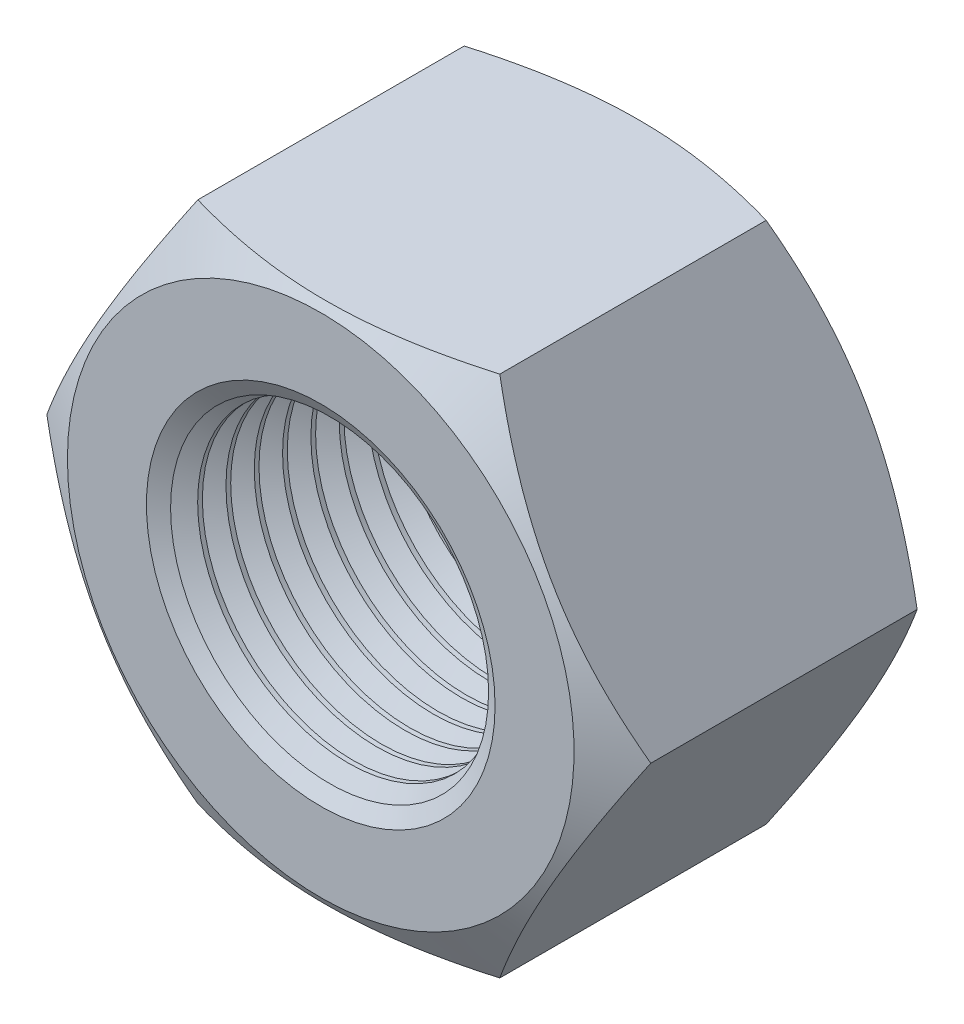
ISO-10303-21;
HEADER;
FILE_DESCRIPTION(('STEP AP214'),'2;1');
FILE_NAME('part.step','',(''),(''),'','','');
FILE_SCHEMA(('AUTOMOTIVE_DESIGN { 1 0 10303 214 1 1 1 1 }'));
ENDSEC;
DATA;
#1=APPLICATION_CONTEXT('core data for automotive mechanical design processes');
#2=APPLICATION_PROTOCOL_DEFINITION('international standard','automotive_design',2000,#1);
#3=PRODUCT_CONTEXT('',#1,'mechanical');
#4=PRODUCT('Part','Part','',(#3));
#5=PRODUCT_RELATED_PRODUCT_CATEGORY('part','',(#4));
#6=PRODUCT_DEFINITION_FORMATION('','',#4);
#7=PRODUCT_DEFINITION_CONTEXT('part definition',#1,'design');
#8=PRODUCT_DEFINITION('design','',#6,#7);
#9=PRODUCT_DEFINITION_SHAPE('','',#8);
#10=(LENGTH_UNIT() NAMED_UNIT(*) SI_UNIT(.MILLI.,.METRE.));
#11=(NAMED_UNIT(*) PLANE_ANGLE_UNIT() SI_UNIT($,.RADIAN.));
#12=(NAMED_UNIT(*) SI_UNIT($,.STERADIAN.) SOLID_ANGLE_UNIT());
#13=UNCERTAINTY_MEASURE_WITH_UNIT(LENGTH_MEASURE(1.E-05),#10,'distance_accuracy_value','');
#14=(GEOMETRIC_REPRESENTATION_CONTEXT(3) GLOBAL_UNCERTAINTY_ASSIGNED_CONTEXT((#13)) GLOBAL_UNIT_ASSIGNED_CONTEXT((#10,
#11,#12)) REPRESENTATION_CONTEXT('',''));
#15=CARTESIAN_POINT('',(0.,0.,0.));
#16=DIRECTION('',(0.,0.,1.));
#17=DIRECTION('',(1.,0.,0.));
#18=AXIS2_PLACEMENT_3D('',#15,#16,#17);
#19=CARTESIAN_POINT('',(0.,0.,-14.8));
#20=DIRECTION('',(0.,0.,1.));
#21=DIRECTION('',(1.,0.,0.));
#22=AXIS2_PLACEMENT_3D('',#19,#20,#21);
#23=CYLINDRICAL_SURFACE('',#22,6.9175);
#24=CARTESIAN_POINT('',(0.,0.,-1.48524999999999));
#25=DIRECTION('',(0.,0.,1.));
#26=DIRECTION('',(1.,0.,0.));
#27=AXIS2_PLACEMENT_3D('',#24,#25,#26);
#28=CIRCLE('',#27,6.9175);
#29=CARTESIAN_POINT('',(6.9175,0.,-1.48524999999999));
#30=VERTEX_POINT('',#29);
#31=EDGE_CURVE('E298',#30,#30,#28,.T.);
#32=ORIENTED_EDGE('',*,*,#31,.F.);
#33=EDGE_LOOP('',(#32));
#34=FACE_BOUND('',#33,.T.);
#35=CARTESIAN_POINT('',(0.,0.,-1.26874999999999));
#36=DIRECTION('',(0.,0.,1.));
#37=DIRECTION('',(1.,0.,0.));
#38=AXIS2_PLACEMENT_3D('',#35,#36,#37);
#39=CIRCLE('',#38,6.9175);
#40=CARTESIAN_POINT('',(6.9175,0.,-1.26874999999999));
#41=VERTEX_POINT('',#40);
#42=EDGE_CURVE('E711',#41,#41,#39,.T.);
#43=ORIENTED_EDGE('',*,*,#42,.T.);
#44=EDGE_LOOP('',(#43));
#45=FACE_BOUND('',#44,.T.);
#46=ADVANCED_FACE('F47',(#34,#45),#23,.F.);
#47=CARTESIAN_POINT('',(0.,0.,-0.624981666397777));
#48=DIRECTION('',(0.,0.,1.));
#49=DIRECTION('',(1.,0.,0.));
#50=AXIS2_PLACEMENT_3D('',#47,#48,#49);
#51=CONICAL_SURFACE('',#50,6.9175,1.0471975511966);
#52=CARTESIAN_POINT('',(0.,0.,0.));
#53=DIRECTION('',(0.,0.,1.));
#54=DIRECTION('',(1.,0.,0.));
#55=AXIS2_PLACEMENT_3D('',#52,#53,#54);
#56=CIRCLE('',#55,8.00000000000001);
#57=CARTESIAN_POINT('',(8.00000000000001,0.,0.));
#58=VERTEX_POINT('',#57);
#59=EDGE_CURVE('E11',#58,#58,#56,.F.);
#60=ORIENTED_EDGE('',*,*,#59,.F.);
#61=EDGE_LOOP('',(#60));
#62=FACE_BOUND('',#61,.T.);
#63=CARTESIAN_POINT('',(0.,0.,-0.405615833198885));
#64=DIRECTION('',(0.,0.,-1.));
#65=DIRECTION('',(-1.,0.,0.));
#66=AXIS2_PLACEMENT_3D('',#63,#64,#65);
#67=CIRCLE('',#66,7.29745276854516);
#68=CARTESIAN_POINT('',(-7.29745276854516,0.,-0.405615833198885));
#69=VERTEX_POINT('',#68);
#70=EDGE_CURVE('E51',#69,#69,#67,.T.);
#71=ORIENTED_EDGE('',*,*,#70,.T.);
#72=EDGE_LOOP('',(#71));
#73=FACE_BOUND('',#72,.T.);
#74=ADVANCED_FACE('F49',(#62,#73),#51,.F.);
#75=CARTESIAN_POINT('',(0.,0.,-2.78424999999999));
#76=DIRECTION('',(0.,0.,1.));
#77=DIRECTION('',(1.,0.,0.));
#78=AXIS2_PLACEMENT_3D('',#75,#76,#77);
#79=CIRCLE('',#78,6.9175);
#80=CARTESIAN_POINT('',(6.9175,0.,-2.78424999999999));
#81=VERTEX_POINT('',#80);
#82=EDGE_CURVE('E292',#81,#81,#79,.T.);
#83=ORIENTED_EDGE('',*,*,#82,.F.);
#84=EDGE_LOOP('',(#83));
#85=FACE_BOUND('',#84,.T.);
#86=CARTESIAN_POINT('',(0.,0.,-2.56774999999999));
#87=DIRECTION('',(0.,0.,1.));
#88=DIRECTION('',(1.,0.,0.));
#89=AXIS2_PLACEMENT_3D('',#86,#87,#88);
#90=CIRCLE('',#89,6.9175);
#91=CARTESIAN_POINT('',(6.9175,0.,-2.56774999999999));
#92=VERTEX_POINT('',#91);
#93=EDGE_CURVE('E295',#92,#92,#90,.T.);
#94=ORIENTED_EDGE('',*,*,#93,.T.);
#95=EDGE_LOOP('',(#94));
#96=FACE_BOUND('',#95,.T.);
#97=ADVANCED_FACE('F274',(#85,#96),#23,.F.);
#98=CARTESIAN_POINT('',(0.,0.,-4.08324999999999));
#99=DIRECTION('',(0.,0.,1.));
#100=DIRECTION('',(1.,0.,0.));
#101=AXIS2_PLACEMENT_3D('',#98,#99,#100);
#102=CIRCLE('',#101,6.9175);
#103=CARTESIAN_POINT('',(6.9175,0.,-4.08324999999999));
#104=VERTEX_POINT('',#103);
#105=EDGE_CURVE('E327',#104,#104,#102,.T.);
#106=ORIENTED_EDGE('',*,*,#105,.F.);
#107=EDGE_LOOP('',(#106));
#108=FACE_BOUND('',#107,.T.);
#109=CARTESIAN_POINT('',(0.,0.,-3.86674999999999));
#110=DIRECTION('',(0.,0.,1.));
#111=DIRECTION('',(1.,0.,0.));
#112=AXIS2_PLACEMENT_3D('',#109,#110,#111);
#113=CIRCLE('',#112,6.9175);
#114=CARTESIAN_POINT('',(6.9175,0.,-3.86674999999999));
#115=VERTEX_POINT('',#114);
#116=EDGE_CURVE('E313',#115,#115,#113,.T.);
#117=ORIENTED_EDGE('',*,*,#116,.T.);
#118=EDGE_LOOP('',(#117));
#119=FACE_BOUND('',#118,.T.);
#120=ADVANCED_FACE('F282',(#108,#119),#23,.F.);
#121=CARTESIAN_POINT('',(0.,0.,-5.38224999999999));
#122=DIRECTION('',(0.,0.,1.));
#123=DIRECTION('',(1.,0.,0.));
#124=AXIS2_PLACEMENT_3D('',#121,#122,#123);
#125=CIRCLE('',#124,6.9175);
#126=CARTESIAN_POINT('',(6.9175,0.,-5.38224999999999));
#127=VERTEX_POINT('',#126);
#128=EDGE_CURVE('E339',#127,#127,#125,.T.);
#129=ORIENTED_EDGE('',*,*,#128,.F.);
#130=EDGE_LOOP('',(#129));
#131=FACE_BOUND('',#130,.T.);
#132=CARTESIAN_POINT('',(0.,0.,-5.16574999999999));
#133=DIRECTION('',(0.,0.,1.));
#134=DIRECTION('',(1.,0.,0.));
#135=AXIS2_PLACEMENT_3D('',#132,#133,#134);
#136=CIRCLE('',#135,6.9175);
#137=CARTESIAN_POINT('',(6.9175,0.,-5.16574999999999));
#138=VERTEX_POINT('',#137);
#139=EDGE_CURVE('E323',#138,#138,#136,.T.);
#140=ORIENTED_EDGE('',*,*,#139,.T.);
#141=EDGE_LOOP('',(#140));
#142=FACE_BOUND('',#141,.T.);
#143=ADVANCED_FACE('F287',(#131,#142),#23,.F.);
#144=CARTESIAN_POINT('',(0.,0.,-6.68124999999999));
#145=DIRECTION('',(0.,0.,1.));
#146=DIRECTION('',(1.,0.,0.));
#147=AXIS2_PLACEMENT_3D('',#144,#145,#146);
#148=CIRCLE('',#147,6.9175);
#149=CARTESIAN_POINT('',(6.9175,0.,-6.68124999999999));
#150=VERTEX_POINT('',#149);
#151=EDGE_CURVE('E351',#150,#150,#148,.T.);
#152=ORIENTED_EDGE('',*,*,#151,.F.);
#153=EDGE_LOOP('',(#152));
#154=FACE_BOUND('',#153,.T.);
#155=CARTESIAN_POINT('',(0.,0.,-6.46474999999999));
#156=DIRECTION('',(0.,0.,1.));
#157=DIRECTION('',(1.,0.,0.));
#158=AXIS2_PLACEMENT_3D('',#155,#156,#157);
#159=CIRCLE('',#158,6.9175);
#160=CARTESIAN_POINT('',(6.9175,0.,-6.46474999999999));
#161=VERTEX_POINT('',#160);
#162=EDGE_CURVE('E335',#161,#161,#159,.T.);
#163=ORIENTED_EDGE('',*,*,#162,.T.);
#164=EDGE_LOOP('',(#163));
#165=FACE_BOUND('',#164,.T.);
#166=ADVANCED_FACE('F485',(#154,#165),#23,.F.);
#167=CARTESIAN_POINT('',(0.,0.,-7.98024999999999));
#168=DIRECTION('',(0.,0.,1.));
#169=DIRECTION('',(1.,0.,0.));
#170=AXIS2_PLACEMENT_3D('',#167,#168,#169);
#171=CIRCLE('',#170,6.9175);
#172=CARTESIAN_POINT('',(6.9175,0.,-7.98024999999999));
#173=VERTEX_POINT('',#172);
#174=EDGE_CURVE('E363',#173,#173,#171,.T.);
#175=ORIENTED_EDGE('',*,*,#174,.F.);
#176=EDGE_LOOP('',(#175));
#177=FACE_BOUND('',#176,.T.);
#178=CARTESIAN_POINT('',(0.,0.,-7.76374999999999));
#179=DIRECTION('',(0.,0.,1.));
#180=DIRECTION('',(1.,0.,0.));
#181=AXIS2_PLACEMENT_3D('',#178,#179,#180);
#182=CIRCLE('',#181,6.9175);
#183=CARTESIAN_POINT('',(6.9175,0.,-7.76374999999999));
#184=VERTEX_POINT('',#183);
#185=EDGE_CURVE('E347',#184,#184,#182,.T.);
#186=ORIENTED_EDGE('',*,*,#185,.T.);
#187=EDGE_LOOP('',(#186));
#188=FACE_BOUND('',#187,.T.);
#189=ADVANCED_FACE('F477',(#177,#188),#23,.F.);
#190=CARTESIAN_POINT('',(0.,0.,-9.27924999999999));
#191=DIRECTION('',(0.,0.,1.));
#192=DIRECTION('',(1.,0.,0.));
#193=AXIS2_PLACEMENT_3D('',#190,#191,#192);
#194=CIRCLE('',#193,6.9175);
#195=CARTESIAN_POINT('',(6.9175,0.,-9.27924999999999));
#196=VERTEX_POINT('',#195);
#197=EDGE_CURVE('E375',#196,#196,#194,.T.);
#198=ORIENTED_EDGE('',*,*,#197,.F.);
#199=EDGE_LOOP('',(#198));
#200=FACE_BOUND('',#199,.T.);
#201=CARTESIAN_POINT('',(0.,0.,-9.06274999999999));
#202=DIRECTION('',(0.,0.,1.));
#203=DIRECTION('',(1.,0.,0.));
#204=AXIS2_PLACEMENT_3D('',#201,#202,#203);
#205=CIRCLE('',#204,6.9175);
#206=CARTESIAN_POINT('',(6.9175,0.,-9.06274999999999));
#207=VERTEX_POINT('',#206);
#208=EDGE_CURVE('E359',#207,#207,#205,.T.);
#209=ORIENTED_EDGE('',*,*,#208,.T.);
#210=EDGE_LOOP('',(#209));
#211=FACE_BOUND('',#210,.T.);
#212=ADVANCED_FACE('F468',(#200,#211),#23,.F.);
#213=CARTESIAN_POINT('',(0.,0.,-10.57825));
#214=DIRECTION('',(0.,0.,1.));
#215=DIRECTION('',(1.,0.,0.));
#216=AXIS2_PLACEMENT_3D('',#213,#214,#215);
#217=CIRCLE('',#216,6.9175);
#218=CARTESIAN_POINT('',(6.9175,0.,-10.57825));
#219=VERTEX_POINT('',#218);
#220=EDGE_CURVE('E387',#219,#219,#217,.T.);
#221=ORIENTED_EDGE('',*,*,#220,.F.);
#222=EDGE_LOOP('',(#221));
#223=FACE_BOUND('',#222,.T.);
#224=CARTESIAN_POINT('',(0.,0.,-10.36175));
#225=DIRECTION('',(0.,0.,1.));
#226=DIRECTION('',(1.,0.,0.));
#227=AXIS2_PLACEMENT_3D('',#224,#225,#226);
#228=CIRCLE('',#227,6.9175);
#229=CARTESIAN_POINT('',(6.9175,0.,-10.36175));
#230=VERTEX_POINT('',#229);
#231=EDGE_CURVE('E371',#230,#230,#228,.T.);
#232=ORIENTED_EDGE('',*,*,#231,.T.);
#233=EDGE_LOOP('',(#232));
#234=FACE_BOUND('',#233,.T.);
#235=ADVANCED_FACE('F460',(#223,#234),#23,.F.);
#236=CARTESIAN_POINT('',(0.,0.,-11.87725));
#237=DIRECTION('',(0.,0.,1.));
#238=DIRECTION('',(1.,0.,0.));
#239=AXIS2_PLACEMENT_3D('',#236,#237,#238);
#240=CIRCLE('',#239,6.9175);
#241=CARTESIAN_POINT('',(6.9175,0.,-11.87725));
#242=VERTEX_POINT('',#241);
#243=EDGE_CURVE('E399',#242,#242,#240,.T.);
#244=ORIENTED_EDGE('',*,*,#243,.F.);
#245=EDGE_LOOP('',(#244));
#246=FACE_BOUND('',#245,.T.);
#247=CARTESIAN_POINT('',(0.,0.,-11.66075));
#248=DIRECTION('',(0.,0.,1.));
#249=DIRECTION('',(1.,0.,0.));
#250=AXIS2_PLACEMENT_3D('',#247,#248,#249);
#251=CIRCLE('',#250,6.9175);
#252=CARTESIAN_POINT('',(6.9175,0.,-11.66075));
#253=VERTEX_POINT('',#252);
#254=EDGE_CURVE('E383',#253,#253,#251,.T.);
#255=ORIENTED_EDGE('',*,*,#254,.T.);
#256=EDGE_LOOP('',(#255));
#257=FACE_BOUND('',#256,.T.);
#258=ADVANCED_FACE('F269',(#246,#257),#23,.F.);
#259=CARTESIAN_POINT('',(0.,0.,-13.17625));
#260=DIRECTION('',(0.,0.,1.));
#261=DIRECTION('',(1.,0.,0.));
#262=AXIS2_PLACEMENT_3D('',#259,#260,#261);
#263=CIRCLE('',#262,6.9175);
#264=CARTESIAN_POINT('',(6.9175,0.,-13.17625));
#265=VERTEX_POINT('',#264);
#266=EDGE_CURVE('E163',#265,#265,#263,.T.);
#267=ORIENTED_EDGE('',*,*,#266,.F.);
#268=EDGE_LOOP('',(#267));
#269=FACE_BOUND('',#268,.T.);
#270=CARTESIAN_POINT('',(0.,0.,-12.95975));
#271=DIRECTION('',(0.,0.,1.));
#272=DIRECTION('',(1.,0.,0.));
#273=AXIS2_PLACEMENT_3D('',#270,#271,#272);
#274=CIRCLE('',#273,6.9175);
#275=CARTESIAN_POINT('',(6.9175,0.,-12.95975));
#276=VERTEX_POINT('',#275);
#277=EDGE_CURVE('E395',#276,#276,#274,.T.);
#278=ORIENTED_EDGE('',*,*,#277,.T.);
#279=EDGE_LOOP('',(#278));
#280=FACE_BOUND('',#279,.T.);
#281=ADVANCED_FACE('F262',(#269,#280),#23,.F.);
#282=CARTESIAN_POINT('',(0.,0.,-14.8));
#283=DIRECTION('',(0.,0.,-1.));
#284=DIRECTION('',(-1.,0.,0.));
#285=AXIS2_PLACEMENT_3D('',#282,#283,#284);
#286=CONICAL_SURFACE('',#285,7.54248166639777,0.523598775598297);
#287=CARTESIAN_POINT('',(0.,0.,-14.8));
#288=DIRECTION('',(0.,0.,1.));
#289=DIRECTION('',(1.,0.,0.));
#290=AXIS2_PLACEMENT_3D('',#287,#288,#289);
#291=CIRCLE('',#290,7.54248166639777);
#292=CARTESIAN_POINT('',(7.54248166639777,0.,-14.8));
#293=VERTEX_POINT('',#292);
#294=EDGE_CURVE('E57',#293,#293,#291,.T.);
#295=ORIENTED_EDGE('',*,*,#294,.F.);
#296=EDGE_LOOP('',(#295));
#297=FACE_BOUND('',#296,.T.);
#298=CARTESIAN_POINT('',(0.,0.,-14.1234375));
#299=DIRECTION('',(0.,0.,1.));
#300=DIRECTION('',(1.,0.,0.));
#301=AXIS2_PLACEMENT_3D('',#298,#299,#300);
#302=CIRCLE('',#301,7.15186812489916);
#303=CARTESIAN_POINT('',(7.15186812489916,0.,-14.1234375));
#304=VERTEX_POINT('',#303);
#305=EDGE_CURVE('E150',#304,#304,#302,.T.);
#306=ORIENTED_EDGE('',*,*,#305,.T.);
#307=EDGE_LOOP('',(#306));
#308=FACE_BOUND('',#307,.T.);
#309=ADVANCED_FACE('F258',(#297,#308),#286,.F.);
#310=CARTESIAN_POINT('',(6.9282032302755,-12.,-14.8));
#311=DIRECTION('',(0.866025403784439,-0.5,0.));
#312=DIRECTION('',(0.5,0.866025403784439,0.));
#313=AXIS2_PLACEMENT_3D('',#310,#311,#312);
#314=PLANE('',#313);
#315=CARTESIAN_POINT('',(6.92808776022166,-12.0002,-1.28836978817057));
#316=CARTESIAN_POINT('',(7.08038456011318,-11.7364142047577,-1.20045598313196));
#317=CARTESIAN_POINT('',(7.2332492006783,-11.4716448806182,-1.11653234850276));
#318=CARTESIAN_POINT('',(7.54020434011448,-10.9399829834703,-0.95777256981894));
#319=CARTESIAN_POINT('',(7.69429522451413,-10.6730897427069,-0.882939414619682));
#320=CARTESIAN_POINT('',(8.15905073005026,-9.86810959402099,-0.673523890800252));
#321=CARTESIAN_POINT('',(8.47155003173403,-9.3268449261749,-0.554409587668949));
#322=CARTESIAN_POINT('',(8.93919090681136,-8.51686717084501,-0.414737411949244));
#323=CARTESIAN_POINT('',(9.09293539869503,-8.25057389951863,-0.374950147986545));
#324=CARTESIAN_POINT('',(9.4011362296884,-7.71675440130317,-0.308229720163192));
#325=CARTESIAN_POINT('',(9.55559258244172,-7.44922815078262,-0.281296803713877));
#326=CARTESIAN_POINT('',(9.86476279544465,-6.91372963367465,-0.240974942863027));
#327=CARTESIAN_POINT('',(10.0194761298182,-6.64575827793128,-0.227569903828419));
#328=CARTESIAN_POINT('',(10.3290461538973,-6.10956726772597,-0.214589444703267));
#329=CARTESIAN_POINT('',(10.4839028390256,-5.84134762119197,-0.215013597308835));
#330=CARTESIAN_POINT('',(10.7734076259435,-5.3399106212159,-0.228726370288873));
#331=CARTESIAN_POINT('',(10.908076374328,-5.10665750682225,-0.240342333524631));
#332=CARTESIAN_POINT('',(11.1771041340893,-4.64068775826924,-0.273814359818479));
#333=CARTESIAN_POINT('',(11.3114631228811,-4.40797116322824,-0.295671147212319));
#334=CARTESIAN_POINT('',(11.5797983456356,-3.94320092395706,-0.34924376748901));
#335=CARTESIAN_POINT('',(11.7137741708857,-3.711147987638,-0.380967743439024));
#336=CARTESIAN_POINT('',(11.9810977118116,-3.24813003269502,-0.45371812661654));
#337=CARTESIAN_POINT('',(12.1144453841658,-3.01716508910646,-0.494745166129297));
#338=CARTESIAN_POINT('',(12.5192297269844,-2.31605804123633,-0.632818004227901));
#339=CARTESIAN_POINT('',(12.789494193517,-1.84794625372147,-0.743631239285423));
#340=CARTESIAN_POINT('',(13.3259930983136,-0.918702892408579,-0.995132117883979));
#341=CARTESIAN_POINT('',(13.5922344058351,-0.457559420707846,-1.13576069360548));
#342=CARTESIAN_POINT('',(13.8565219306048,0.000200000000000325,-1.28836978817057));
#343=B_SPLINE_CURVE_WITH_KNOTS('',3,(#315,#316,#317,#318,#319,#320,#321,#322,#323,#324,#325,
#326,#327,#328,#329,#330,#331,#332,#333,#334,#335,#336,#337,#338,#339,#340,#341,#342),
.UNSPECIFIED.,.F.,.F.,(4,2,2,2,2,2,2,2,2,2,2,2,2,4),(0.,0.951004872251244,1.90232158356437,
3.80900466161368,4.7389455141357,5.66890426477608,6.59775529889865,7.52657763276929,
8.33514643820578,9.14377244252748,9.95306755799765,10.7624176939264,12.4167102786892,
14.0677556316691),.UNSPECIFIED.);
#344=CARTESIAN_POINT('',(6.92820323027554,-12.,-1.28830312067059));
#345=VERTEX_POINT('',#344);
#346=CARTESIAN_POINT('',(13.856406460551,0.,-1.28830312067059));
#347=VERTEX_POINT('',#346);
#348=EDGE_CURVE('E65',#345,#347,#343,.T.);
#349=ORIENTED_EDGE('',*,*,#348,.F.);
#350=DIRECTION('',(0.,0.,1.));
#351=VECTOR('',#350,1.);
#352=CARTESIAN_POINT('',(6.9282032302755,-12.,-14.8));
#353=LINE('',#352,#351);
#354=CARTESIAN_POINT('',(6.92820323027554,-12.,-13.5116968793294));
#355=VERTEX_POINT('',#354);
#356=EDGE_CURVE('E134',#355,#345,#353,.T.);
#357=ORIENTED_EDGE('',*,*,#356,.F.);
#358=CARTESIAN_POINT('',(13.8565219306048,0.000200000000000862,-13.5116302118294));
#359=CARTESIAN_POINT('',(13.7042251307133,-0.263585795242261,-13.599544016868));
#360=CARTESIAN_POINT('',(13.5513604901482,-0.528355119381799,-13.6834676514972));
#361=CARTESIAN_POINT('',(13.244405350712,-1.06001701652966,-13.8422274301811));
#362=CARTESIAN_POINT('',(13.0903144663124,-1.32691025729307,-13.9170605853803));
#363=CARTESIAN_POINT('',(12.6255589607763,-2.13189040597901,-14.1264761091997));
#364=CARTESIAN_POINT('',(12.3130596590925,-2.6731550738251,-14.2455904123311));
#365=CARTESIAN_POINT('',(11.8454187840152,-3.48313282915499,-14.3852625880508));
#366=CARTESIAN_POINT('',(11.6916742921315,-3.74942610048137,-14.4250498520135));
#367=CARTESIAN_POINT('',(11.3834734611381,-4.28324559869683,-14.4917702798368));
#368=CARTESIAN_POINT('',(11.2290171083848,-4.55077184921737,-14.5187031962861));
#369=CARTESIAN_POINT('',(10.9198468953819,-5.08627036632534,-14.559025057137));
#370=CARTESIAN_POINT('',(10.7651335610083,-5.35424172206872,-14.5724300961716));
#371=CARTESIAN_POINT('',(10.4555635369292,-5.89043273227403,-14.5854105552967));
#372=CARTESIAN_POINT('',(10.3007068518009,-6.15865237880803,-14.5849864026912));
#373=CARTESIAN_POINT('',(10.011202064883,-6.66008937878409,-14.5712736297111));
#374=CARTESIAN_POINT('',(9.87653331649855,-6.89334249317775,-14.5596576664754));
#375=CARTESIAN_POINT('',(9.60750555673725,-7.35931224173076,-14.5261856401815));
#376=CARTESIAN_POINT('',(9.47314656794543,-7.59202883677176,-14.5043288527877));
#377=CARTESIAN_POINT('',(9.20481134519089,-8.05679907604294,-14.450756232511));
#378=CARTESIAN_POINT('',(9.07083551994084,-8.288852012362,-14.419032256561));
#379=CARTESIAN_POINT('',(8.80351197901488,-8.75186996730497,-14.3462818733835));
#380=CARTESIAN_POINT('',(8.67016430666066,-8.98283491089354,-14.3052548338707));
#381=CARTESIAN_POINT('',(8.2653799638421,-9.68394195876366,-14.1671819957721));
#382=CARTESIAN_POINT('',(7.99511549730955,-10.1520537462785,-14.0563687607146));
#383=CARTESIAN_POINT('',(7.45861659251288,-11.0812971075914,-13.804867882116));
#384=CARTESIAN_POINT('',(7.19237528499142,-11.5424405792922,-13.6642393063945));
#385=CARTESIAN_POINT('',(6.92808776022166,-12.0002,-13.5116302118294));
#386=B_SPLINE_CURVE_WITH_KNOTS('',3,(#358,#359,#360,#361,#362,#363,#364,#365,#366,#367,#368,
#369,#370,#371,#372,#373,#374,#375,#376,#377,#378,#379,#380,#381,#382,#383,#384,#385),
.UNSPECIFIED.,.F.,.F.,(4,2,2,2,2,2,2,2,2,2,2,2,2,4),(0.,0.951004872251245,1.90232158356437,
3.80900466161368,4.73894551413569,5.66890426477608,6.59775529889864,7.52657763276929,
8.33514643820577,9.14377244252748,9.95306755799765,10.7624176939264,12.4167102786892,
14.0677556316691),.UNSPECIFIED.);
#387=CARTESIAN_POINT('',(13.856406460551,0.,-13.5116968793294));
#388=VERTEX_POINT('',#387);
#389=EDGE_CURVE('E147',#388,#355,#386,.T.);
#390=ORIENTED_EDGE('',*,*,#389,.F.);
#391=DIRECTION('',(0.,0.,1.));
#392=VECTOR('',#391,1.);
#393=CARTESIAN_POINT('',(13.856406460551,0.,-14.8));
#394=LINE('',#393,#392);
#395=EDGE_CURVE('E143',#388,#347,#394,.T.);
#396=ORIENTED_EDGE('',*,*,#395,.T.);
#397=EDGE_LOOP('',(#349,#357,#390,#396));
#398=FACE_BOUND('',#397,.T.);
#399=ADVANCED_FACE('F230',(#398),#314,.T.);
#400=CARTESIAN_POINT('',(-6.92820323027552,-12.,-14.8));
#401=DIRECTION('',(0.,-1.,0.));
#402=DIRECTION('',(0.,0.,-1.));
#403=AXIS2_PLACEMENT_3D('',#400,#401,#402);
#404=PLANE('',#403);
#405=CARTESIAN_POINT('',(-18.3446032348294,-12.,-5.94432234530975));
#406=CARTESIAN_POINT('',(-18.0812955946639,-12.,-5.81710561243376));
#407=CARTESIAN_POINT('',(-17.8176688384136,-12.,-5.69054969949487));
#408=CARTESIAN_POINT('',(-17.2897096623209,-12.,-5.43891126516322));
#409=CARTESIAN_POINT('',(-17.0253772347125,-12.,-5.31382876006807));
#410=CARTESIAN_POINT('',(-16.2311424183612,-12.,-4.94098252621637));
#411=CARTESIAN_POINT('',(-15.7000886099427,-12.,-4.6956618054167));
#412=CARTESIAN_POINT('',(-14.6312468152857,-12.,-4.21171472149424));
#413=CARTESIAN_POINT('',(-14.0934376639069,-12.,-3.97313498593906));
#414=CARTESIAN_POINT('',(-13.0133884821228,-12.,-3.50626232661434));
#415=CARTESIAN_POINT('',(-12.4711486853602,-12.,-3.27796886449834));
#416=CARTESIAN_POINT('',(-11.3747844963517,-12.,-2.83175886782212));
#417=CARTESIAN_POINT('',(-10.8205955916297,-12.,-2.61400001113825));
#418=CARTESIAN_POINT('',(-9.70566657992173,-12.,-2.19561145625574));
#419=CARTESIAN_POINT('',(-9.14492575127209,-12.,-1.9949836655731));
#420=CARTESIAN_POINT('',(-8.01718109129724,-12.,-1.6162726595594));
#421=CARTESIAN_POINT('',(-7.45019357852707,-12.,-1.43814124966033));
#422=CARTESIAN_POINT('',(-6.30810460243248,-12.,-1.11021889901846));
#423=CARTESIAN_POINT('',(-5.7330057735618,-12.,-0.960418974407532));
#424=CARTESIAN_POINT('',(-4.86416258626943,-12.,-0.762464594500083));
#425=CARTESIAN_POINT('',(-4.57344737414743,-12.,-0.70092618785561));
#426=CARTESIAN_POINT('',(-3.99008816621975,-12.,-0.587740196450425));
#427=CARTESIAN_POINT('',(-3.69744421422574,-12.,-0.536092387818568));
#428=CARTESIAN_POINT('',(-3.1104206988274,-12.,-0.443604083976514));
#429=CARTESIAN_POINT('',(-2.81604099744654,-12.,-0.402764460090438));
#430=CARTESIAN_POINT('',(-2.22590203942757,-12.,-0.332716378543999));
#431=CARTESIAN_POINT('',(-1.930142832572,-12.,-0.303507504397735));
#432=CARTESIAN_POINT('',(-1.33951990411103,-12.,-0.257503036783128));
#433=CARTESIAN_POINT('',(-1.04466219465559,-12.,-0.240630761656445));
#434=CARTESIAN_POINT('',(-0.454498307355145,-12.,-0.219388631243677));
#435=CARTESIAN_POINT('',(-0.159192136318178,-12.,-0.21501858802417));
#436=CARTESIAN_POINT('',(0.43125675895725,-12.,-0.218884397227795));
#437=CARTESIAN_POINT('',(0.726399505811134,-12.,-0.227116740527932));
#438=CARTESIAN_POINT('',(1.31608163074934,-12.,-0.255983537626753));
#439=CARTESIAN_POINT('',(1.61062097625,-12.,-0.276618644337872));
#440=CARTESIAN_POINT('',(2.32524257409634,-12.,-0.341301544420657));
#441=CARTESIAN_POINT('',(2.74476957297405,-12.,-0.391604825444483));
#442=CARTESIAN_POINT('',(3.58051682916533,-12.,-0.514565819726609));
#443=CARTESIAN_POINT('',(3.9967365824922,-12.,-0.587226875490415));
#444=CARTESIAN_POINT('',(5.24117103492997,-12.,-0.835099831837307));
#445=CARTESIAN_POINT('',(6.06353260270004,-12.,-1.04003542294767));
#446=CARTESIAN_POINT('',(7.29358946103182,-12.,-1.39315624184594));
#447=CARTESIAN_POINT('',(7.70771781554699,-12.,-1.52020059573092));
#448=CARTESIAN_POINT('',(8.53197351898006,-12.,-1.78689253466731));
#449=CARTESIAN_POINT('',(8.942100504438,-12.,-1.92654125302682));
#450=CARTESIAN_POINT('',(9.75630809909,-12.,-2.21547115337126));
#451=CARTESIAN_POINT('',(10.1604097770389,-12.,-2.36469346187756));
#452=CARTESIAN_POINT('',(10.7640208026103,-12.,-2.59495642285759));
#453=CARTESIAN_POINT('',(10.9647685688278,-12.,-2.67276919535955));
#454=CARTESIAN_POINT('',(11.3654854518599,-12.,-2.8303637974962));
#455=CARTESIAN_POINT('',(11.5654545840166,-12.,-2.9101455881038));
#456=CARTESIAN_POINT('',(11.7650614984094,-12.,-2.99082293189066));
#457=B_SPLINE_CURVE_WITH_KNOTS('',3,(#405,#406,#407,#408,#409,#410,#411,#412,#413,#414,#415,
#416,#417,#418,#419,#420,#421,#422,#423,#424,#425,#426,#427,#428,#429,#430,#431,#432,#433,#434,
#435,#436,#437,#438,#439,#440,#441,#442,#443,#444,#445,#446,#447,#448,#449,#450,#451,#452,#453,
#454,#455,#456),.UNSPECIFIED.,.F.,.F.,(4,2,2,2,2,2,2,2,2,2,2,2,2,2,2,2,2,2,2,2,2,2,2,2,2,4),(0.,
0.877286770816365,1.75458323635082,3.50946322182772,5.27443821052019,7.03932071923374,
8.82541303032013,10.6117039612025,12.3941007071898,14.1759313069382,15.0672612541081,
15.9585710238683,16.8499526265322,17.741302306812,18.6270633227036,19.5128110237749,
20.3983121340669,21.2838598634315,22.5507356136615,23.8178008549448,26.3568198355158,
27.656250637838,28.9557983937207,30.2480046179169,30.8938984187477,31.5397794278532),.UNSPECIFIED.);
#458=CARTESIAN_POINT('',(-6.92820323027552,-12.,-1.28830312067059));
#459=VERTEX_POINT('',#458);
#460=EDGE_CURVE('E124',#459,#345,#457,.T.);
#461=ORIENTED_EDGE('',*,*,#460,.F.);
#462=DIRECTION('',(0.,0.,1.));
#463=VECTOR('',#462,1.);
#464=CARTESIAN_POINT('',(-6.92820323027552,-12.,-14.8));
#465=LINE('',#464,#463);
#466=CARTESIAN_POINT('',(-6.92820323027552,-12.,-13.5116968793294));
#467=VERTEX_POINT('',#466);
#468=EDGE_CURVE('E122',#467,#459,#465,.T.);
#469=ORIENTED_EDGE('',*,*,#468,.F.);
#470=CARTESIAN_POINT('',(-18.3446032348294,-12.,-8.85567765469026));
#471=CARTESIAN_POINT('',(-18.0812955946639,-12.,-8.98289438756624));
#472=CARTESIAN_POINT('',(-17.8176688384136,-12.,-9.10945030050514));
#473=CARTESIAN_POINT('',(-17.2897096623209,-12.,-9.36108873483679));
#474=CARTESIAN_POINT('',(-17.0253772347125,-12.,-9.48617123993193));
#475=CARTESIAN_POINT('',(-16.2311424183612,-12.,-9.85901747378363));
#476=CARTESIAN_POINT('',(-15.7000886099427,-12.,-10.1043381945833));
#477=CARTESIAN_POINT('',(-14.6312468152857,-12.,-10.5882852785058));
#478=CARTESIAN_POINT('',(-14.0934376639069,-12.,-10.8268650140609));
#479=CARTESIAN_POINT('',(-13.0133884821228,-12.,-11.2937376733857));
#480=CARTESIAN_POINT('',(-12.4711486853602,-12.,-11.5220311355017));
#481=CARTESIAN_POINT('',(-11.3747844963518,-12.,-11.9682411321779));
#482=CARTESIAN_POINT('',(-10.8205955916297,-12.,-12.1859999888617));
#483=CARTESIAN_POINT('',(-9.70566657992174,-12.,-12.6043885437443));
#484=CARTESIAN_POINT('',(-9.14492575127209,-12.,-12.8050163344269));
#485=CARTESIAN_POINT('',(-8.01718109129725,-12.,-13.1837273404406));
#486=CARTESIAN_POINT('',(-7.45019357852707,-12.,-13.3618587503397));
#487=CARTESIAN_POINT('',(-6.30810460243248,-12.,-13.6897811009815));
#488=CARTESIAN_POINT('',(-5.73300577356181,-12.,-13.8395810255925));
#489=CARTESIAN_POINT('',(-4.86416258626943,-12.,-14.0375354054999));
#490=CARTESIAN_POINT('',(-4.57344737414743,-12.,-14.0990738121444));
#491=CARTESIAN_POINT('',(-3.99008816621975,-12.,-14.2122598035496));
#492=CARTESIAN_POINT('',(-3.69744421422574,-12.,-14.2639076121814));
#493=CARTESIAN_POINT('',(-3.1104206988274,-12.,-14.3563959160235));
#494=CARTESIAN_POINT('',(-2.81604099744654,-12.,-14.3972355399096));
#495=CARTESIAN_POINT('',(-2.22590203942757,-12.,-14.467283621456));
#496=CARTESIAN_POINT('',(-1.930142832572,-12.,-14.4964924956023));
#497=CARTESIAN_POINT('',(-1.33951990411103,-12.,-14.5424969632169));
#498=CARTESIAN_POINT('',(-1.04466219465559,-12.,-14.5593692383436));
#499=CARTESIAN_POINT('',(-0.454498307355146,-12.,-14.5806113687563));
#500=CARTESIAN_POINT('',(-0.159192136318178,-12.,-14.5849814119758));
#501=CARTESIAN_POINT('',(0.43125675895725,-12.,-14.5811156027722));
#502=CARTESIAN_POINT('',(0.726399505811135,-12.,-14.5728832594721));
#503=CARTESIAN_POINT('',(1.31608163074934,-12.,-14.5440164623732));
#504=CARTESIAN_POINT('',(1.61062097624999,-12.,-14.5233813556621));
#505=CARTESIAN_POINT('',(2.32524257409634,-12.,-14.4586984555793));
#506=CARTESIAN_POINT('',(2.74476957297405,-12.,-14.4083951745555));
#507=CARTESIAN_POINT('',(3.58051682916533,-12.,-14.2854341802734));
#508=CARTESIAN_POINT('',(3.9967365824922,-12.,-14.2127731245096));
#509=CARTESIAN_POINT('',(5.24117103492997,-12.,-13.9649001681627));
#510=CARTESIAN_POINT('',(6.06353260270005,-12.,-13.7599645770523));
#511=CARTESIAN_POINT('',(7.29358946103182,-12.,-13.4068437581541));
#512=CARTESIAN_POINT('',(7.707717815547,-12.,-13.2797994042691));
#513=CARTESIAN_POINT('',(8.53197351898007,-12.,-13.0131074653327));
#514=CARTESIAN_POINT('',(8.94210050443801,-12.,-12.8734587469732));
#515=CARTESIAN_POINT('',(9.75630809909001,-12.,-12.5845288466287));
#516=CARTESIAN_POINT('',(10.1604097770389,-12.,-12.4353065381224));
#517=CARTESIAN_POINT('',(10.7640208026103,-12.,-12.2050435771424));
#518=CARTESIAN_POINT('',(10.9647685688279,-12.,-12.1272308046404));
#519=CARTESIAN_POINT('',(11.3654854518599,-12.,-11.9696362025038));
#520=CARTESIAN_POINT('',(11.5654545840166,-12.,-11.8898544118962));
#521=CARTESIAN_POINT('',(11.7650614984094,-12.,-11.8091770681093));
#522=B_SPLINE_CURVE_WITH_KNOTS('',3,(#470,#471,#472,#473,#474,#475,#476,#477,#478,#479,#480,
#481,#482,#483,#484,#485,#486,#487,#488,#489,#490,#491,#492,#493,#494,#495,#496,#497,#498,#499,
#500,#501,#502,#503,#504,#505,#506,#507,#508,#509,#510,#511,#512,#513,#514,#515,#516,#517,#518,
#519,#520,#521),.UNSPECIFIED.,.F.,.F.,(4,2,2,2,2,2,2,2,2,2,2,2,2,2,2,2,2,2,2,2,2,2,2,2,2,4),(0.,
0.877286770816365,1.75458323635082,3.50946322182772,5.27443821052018,7.03932071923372,
8.82541303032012,10.6117039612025,12.3941007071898,14.1759313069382,15.0672612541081,
15.9585710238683,16.8499526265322,17.741302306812,18.6270633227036,19.5128110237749,
20.3983121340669,21.2838598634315,22.5507356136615,23.8178008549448,26.3568198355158,
27.656250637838,28.9557983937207,30.2480046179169,30.8938984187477,31.5397794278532),.UNSPECIFIED.);
#523=EDGE_CURVE('E237',#355,#467,#522,.F.);
#524=ORIENTED_EDGE('',*,*,#523,.F.);
#525=ORIENTED_EDGE('',*,*,#356,.T.);
#526=EDGE_LOOP('',(#461,#469,#524,#525));
#527=FACE_BOUND('',#526,.T.);
#528=ADVANCED_FACE('F226',(#527),#404,.T.);
#529=CARTESIAN_POINT('',(-13.856406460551,0.,-14.8));
#530=DIRECTION('',(-0.866025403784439,-0.5,0.));
#531=DIRECTION('',(0.5,-0.866025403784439,0.));
#532=AXIS2_PLACEMENT_3D('',#529,#530,#531);
#533=PLANE('',#532);
#534=CARTESIAN_POINT('',(-13.8565219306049,0.000199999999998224,-1.28836978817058));
#535=CARTESIAN_POINT('',(-13.7042251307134,-0.263585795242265,-1.20045598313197));
#536=CARTESIAN_POINT('',(-13.5513604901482,-0.528355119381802,-1.11653234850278));
#537=CARTESIAN_POINT('',(-13.244405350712,-1.06001701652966,-0.95777256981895));
#538=CARTESIAN_POINT('',(-13.0903144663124,-1.32691025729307,-0.882939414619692));
#539=CARTESIAN_POINT('',(-12.6255589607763,-2.13189040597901,-0.673523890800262));
#540=CARTESIAN_POINT('',(-12.3130596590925,-2.6731550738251,-0.55440958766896));
#541=CARTESIAN_POINT('',(-11.8454187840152,-3.483132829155,-0.414737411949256));
#542=CARTESIAN_POINT('',(-11.6916742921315,-3.74942610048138,-0.374950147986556));
#543=CARTESIAN_POINT('',(-11.3834734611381,-4.28324559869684,-0.308229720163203));
#544=CARTESIAN_POINT('',(-11.2290171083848,-4.55077184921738,-0.281296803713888));
#545=CARTESIAN_POINT('',(-10.9198468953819,-5.08627036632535,-0.240974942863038));
#546=CARTESIAN_POINT('',(-10.7651335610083,-5.35424172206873,-0.227569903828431));
#547=CARTESIAN_POINT('',(-10.4555635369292,-5.89043273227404,-0.21458944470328));
#548=CARTESIAN_POINT('',(-10.3007068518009,-6.15865237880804,-0.215013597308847));
#549=CARTESIAN_POINT('',(-10.0112020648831,-6.66008937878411,-0.228726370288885));
#550=CARTESIAN_POINT('',(-9.87653331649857,-6.89334249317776,-0.240342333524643));
#551=CARTESIAN_POINT('',(-9.60750555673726,-7.35931224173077,-0.273814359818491));
#552=CARTESIAN_POINT('',(-9.47314656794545,-7.59202883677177,-0.295671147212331));
#553=CARTESIAN_POINT('',(-9.20481134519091,-8.05679907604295,-0.349243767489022));
#554=CARTESIAN_POINT('',(-9.07083551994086,-8.28885201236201,-0.380967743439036));
#555=CARTESIAN_POINT('',(-8.8035119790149,-8.75186996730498,-0.453718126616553));
#556=CARTESIAN_POINT('',(-8.67016430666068,-8.98283491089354,-0.49474516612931));
#557=CARTESIAN_POINT('',(-8.26537996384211,-9.68394195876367,-0.632818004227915));
#558=CARTESIAN_POINT('',(-7.99511549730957,-10.1520537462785,-0.743631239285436));
#559=CARTESIAN_POINT('',(-7.4586165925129,-11.0812971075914,-0.99513211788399));
#560=CARTESIAN_POINT('',(-7.19237528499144,-11.5424405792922,-1.13576069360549));
#561=CARTESIAN_POINT('',(-6.92808776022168,-12.0002,-1.28836978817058));
#562=B_SPLINE_CURVE_WITH_KNOTS('',3,(#534,#535,#536,#537,#538,#539,#540,#541,#542,#543,#544,
#545,#546,#547,#548,#549,#550,#551,#552,#553,#554,#555,#556,#557,#558,#559,#560,#561),
.UNSPECIFIED.,.F.,.F.,(4,2,2,2,2,2,2,2,2,2,2,2,2,4),(0.,0.951004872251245,1.90232158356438,
3.80900466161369,4.7389455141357,5.66890426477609,6.59775529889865,7.5265776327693,
8.33514643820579,9.14377244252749,9.95306755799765,10.7624176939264,12.4167102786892,
14.0677556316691),.UNSPECIFIED.);
#563=CARTESIAN_POINT('',(-13.856406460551,0.,-1.28830312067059));
#564=VERTEX_POINT('',#563);
#565=EDGE_CURVE('E105',#564,#459,#562,.T.);
#566=ORIENTED_EDGE('',*,*,#565,.F.);
#567=DIRECTION('',(0.,0.,1.));
#568=VECTOR('',#567,1.);
#569=CARTESIAN_POINT('',(-13.856406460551,0.,-14.8));
#570=LINE('',#569,#568);
#571=CARTESIAN_POINT('',(-13.856406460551,0.,-13.5116968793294));
#572=VERTEX_POINT('',#571);
#573=EDGE_CURVE('E120',#572,#564,#570,.T.);
#574=ORIENTED_EDGE('',*,*,#573,.F.);
#575=CARTESIAN_POINT('',(-6.92808776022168,-12.0002,-13.5116302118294));
#576=CARTESIAN_POINT('',(-7.0803845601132,-11.7364142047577,-13.599544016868));
#577=CARTESIAN_POINT('',(-7.23324920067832,-11.4716448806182,-13.6834676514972));
#578=CARTESIAN_POINT('',(-7.5402043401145,-10.9399829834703,-13.8422274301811));
#579=CARTESIAN_POINT('',(-7.69429522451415,-10.6730897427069,-13.9170605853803));
#580=CARTESIAN_POINT('',(-8.15905073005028,-9.86810959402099,-14.1264761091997));
#581=CARTESIAN_POINT('',(-8.47155003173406,-9.3268449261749,-14.245590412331));
#582=CARTESIAN_POINT('',(-8.93919090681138,-8.51686717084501,-14.3852625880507));
#583=CARTESIAN_POINT('',(-9.09293539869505,-8.25057389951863,-14.4250498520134));
#584=CARTESIAN_POINT('',(-9.40113622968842,-7.71675440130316,-14.4917702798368));
#585=CARTESIAN_POINT('',(-9.55559258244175,-7.44922815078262,-14.5187031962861));
#586=CARTESIAN_POINT('',(-9.86476279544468,-6.91372963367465,-14.559025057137));
#587=CARTESIAN_POINT('',(-10.0194761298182,-6.64575827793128,-14.5724300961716));
#588=CARTESIAN_POINT('',(-10.3290461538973,-6.10956726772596,-14.5854105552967));
#589=CARTESIAN_POINT('',(-10.4839028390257,-5.84134762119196,-14.5849864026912));
#590=CARTESIAN_POINT('',(-10.7734076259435,-5.3399106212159,-14.5712736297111));
#591=CARTESIAN_POINT('',(-10.908076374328,-5.10665750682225,-14.5596576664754));
#592=CARTESIAN_POINT('',(-11.1771041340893,-4.64068775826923,-14.5261856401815));
#593=CARTESIAN_POINT('',(-11.3114631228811,-4.40797116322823,-14.5043288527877));
#594=CARTESIAN_POINT('',(-11.5797983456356,-3.94320092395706,-14.450756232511));
#595=CARTESIAN_POINT('',(-11.7137741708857,-3.711147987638,-14.419032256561));
#596=CARTESIAN_POINT('',(-11.9810977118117,-3.24813003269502,-14.3462818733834));
#597=CARTESIAN_POINT('',(-12.1144453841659,-3.01716508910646,-14.3052548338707));
#598=CARTESIAN_POINT('',(-12.5192297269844,-2.31605804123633,-14.1671819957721));
#599=CARTESIAN_POINT('',(-12.789494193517,-1.84794625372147,-14.0563687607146));
#600=CARTESIAN_POINT('',(-13.3259930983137,-0.918702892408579,-13.804867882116));
#601=CARTESIAN_POINT('',(-13.5922344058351,-0.457559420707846,-13.6642393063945));
#602=CARTESIAN_POINT('',(-13.8565219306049,0.000199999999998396,-13.5116302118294));
#603=B_SPLINE_CURVE_WITH_KNOTS('',3,(#575,#576,#577,#578,#579,#580,#581,#582,#583,#584,#585,
#586,#587,#588,#589,#590,#591,#592,#593,#594,#595,#596,#597,#598,#599,#600,#601,#602),
.UNSPECIFIED.,.F.,.F.,(4,2,2,2,2,2,2,2,2,2,2,2,2,4),(0.,0.951004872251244,1.90232158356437,
3.80900466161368,4.7389455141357,5.66890426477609,6.59775529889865,7.5265776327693,
8.33514643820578,9.14377244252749,9.95306755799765,10.7624176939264,12.4167102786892,
14.0677556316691),.UNSPECIFIED.);
#604=EDGE_CURVE('E245',#467,#572,#603,.T.);
#605=ORIENTED_EDGE('',*,*,#604,.F.);
#606=ORIENTED_EDGE('',*,*,#468,.T.);
#607=EDGE_LOOP('',(#566,#574,#605,#606));
#608=FACE_BOUND('',#607,.T.);
#609=ADVANCED_FACE('F118',(#608),#533,.T.);
#610=CARTESIAN_POINT('',(-6.92820323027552,12.,-14.8));
#611=DIRECTION('',(-0.866025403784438,0.5,0.));
#612=DIRECTION('',(-0.5,-0.866025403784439,0.));
#613=AXIS2_PLACEMENT_3D('',#610,#611,#612);
#614=PLANE('',#613);
#615=CARTESIAN_POINT('',(-6.92808776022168,12.0002,-1.28836978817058));
#616=CARTESIAN_POINT('',(-7.0803845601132,11.7364142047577,-1.20045598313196));
#617=CARTESIAN_POINT('',(-7.23324920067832,11.4716448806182,-1.11653234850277));
#618=CARTESIAN_POINT('',(-7.54020434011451,10.9399829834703,-0.957772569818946));
#619=CARTESIAN_POINT('',(-7.69429522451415,10.6730897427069,-0.882939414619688));
#620=CARTESIAN_POINT('',(-8.15905073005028,9.86810959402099,-0.673523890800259));
#621=CARTESIAN_POINT('',(-8.47155003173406,9.3268449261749,-0.554409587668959));
#622=CARTESIAN_POINT('',(-8.93919090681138,8.516867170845,-0.414737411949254));
#623=CARTESIAN_POINT('',(-9.09293539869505,8.25057389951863,-0.374950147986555));
#624=CARTESIAN_POINT('',(-9.40113622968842,7.71675440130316,-0.308229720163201));
#625=CARTESIAN_POINT('',(-9.55559258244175,7.44922815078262,-0.281296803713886));
#626=CARTESIAN_POINT('',(-9.86476279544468,6.91372963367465,-0.240974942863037));
#627=CARTESIAN_POINT('',(-10.0194761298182,6.64575827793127,-0.22756990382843));
#628=CARTESIAN_POINT('',(-10.3290461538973,6.10956726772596,-0.21458944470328));
#629=CARTESIAN_POINT('',(-10.4839028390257,5.84134762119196,-0.215013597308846));
#630=CARTESIAN_POINT('',(-10.7734076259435,5.3399106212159,-0.228726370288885));
#631=CARTESIAN_POINT('',(-10.908076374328,5.10665750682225,-0.240342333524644));
#632=CARTESIAN_POINT('',(-11.1771041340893,4.64068775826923,-0.273814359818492));
#633=CARTESIAN_POINT('',(-11.3114631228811,4.40797116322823,-0.295671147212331));
#634=CARTESIAN_POINT('',(-11.5797983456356,3.94320092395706,-0.349243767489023));
#635=CARTESIAN_POINT('',(-11.7137741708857,3.711147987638,-0.380967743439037));
#636=CARTESIAN_POINT('',(-11.9810977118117,3.24813003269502,-0.453718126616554));
#637=CARTESIAN_POINT('',(-12.1144453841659,3.01716508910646,-0.494745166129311));
#638=CARTESIAN_POINT('',(-12.5192297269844,2.31605804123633,-0.632818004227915));
#639=CARTESIAN_POINT('',(-12.789494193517,1.84794625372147,-0.743631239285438));
#640=CARTESIAN_POINT('',(-13.3259930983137,0.918702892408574,-0.995132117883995));
#641=CARTESIAN_POINT('',(-13.5922344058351,0.457559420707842,-1.13576069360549));
#642=CARTESIAN_POINT('',(-13.8565219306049,-0.000200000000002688,-1.28836978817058));
#643=B_SPLINE_CURVE_WITH_KNOTS('',3,(#615,#616,#617,#618,#619,#620,#621,#622,#623,#624,#625,
#626,#627,#628,#629,#630,#631,#632,#633,#634,#635,#636,#637,#638,#639,#640,#641,#642),
.UNSPECIFIED.,.F.,.F.,(4,2,2,2,2,2,2,2,2,2,2,2,2,4),(0.,0.951004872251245,1.90232158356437,
3.80900466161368,4.7389455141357,5.66890426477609,6.59775529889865,7.5265776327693,
8.33514643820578,9.14377244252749,9.95306755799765,10.7624176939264,12.4167102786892,
14.0677556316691),.UNSPECIFIED.);
#644=CARTESIAN_POINT('',(-6.92820323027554,12.,-1.28830312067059));
#645=VERTEX_POINT('',#644);
#646=EDGE_CURVE('E101',#645,#564,#643,.T.);
#647=ORIENTED_EDGE('',*,*,#646,.F.);
#648=DIRECTION('',(0.,0.,1.));
#649=VECTOR('',#648,1.);
#650=CARTESIAN_POINT('',(-6.92820323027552,12.,-14.8));
#651=LINE('',#650,#649);
#652=CARTESIAN_POINT('',(-6.92820323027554,12.,-13.5116968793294));
#653=VERTEX_POINT('',#652);
#654=EDGE_CURVE('E130',#653,#645,#651,.T.);
#655=ORIENTED_EDGE('',*,*,#654,.F.);
#656=CARTESIAN_POINT('',(-13.8565219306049,-0.000200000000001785,-13.5116302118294));
#657=CARTESIAN_POINT('',(-13.7042251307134,0.26358579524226,-13.599544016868));
#658=CARTESIAN_POINT('',(-13.5513604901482,0.528355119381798,-13.6834676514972));
#659=CARTESIAN_POINT('',(-13.244405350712,1.06001701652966,-13.8422274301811));
#660=CARTESIAN_POINT('',(-13.0903144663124,1.32691025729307,-13.9170605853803));
#661=CARTESIAN_POINT('',(-12.6255589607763,2.13189040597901,-14.1264761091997));
#662=CARTESIAN_POINT('',(-12.3130596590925,2.6731550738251,-14.245590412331));
#663=CARTESIAN_POINT('',(-11.8454187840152,3.483132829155,-14.3852625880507));
#664=CARTESIAN_POINT('',(-11.6916742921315,3.74942610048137,-14.4250498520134));
#665=CARTESIAN_POINT('',(-11.3834734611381,4.28324559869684,-14.4917702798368));
#666=CARTESIAN_POINT('',(-11.2290171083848,4.55077184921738,-14.5187031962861));
#667=CARTESIAN_POINT('',(-10.9198468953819,5.08627036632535,-14.559025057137));
#668=CARTESIAN_POINT('',(-10.7651335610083,5.35424172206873,-14.5724300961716));
#669=CARTESIAN_POINT('',(-10.4555635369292,5.89043273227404,-14.5854105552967));
#670=CARTESIAN_POINT('',(-10.3007068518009,6.15865237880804,-14.5849864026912));
#671=CARTESIAN_POINT('',(-10.0112020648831,6.66008937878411,-14.5712736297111));
#672=CARTESIAN_POINT('',(-9.87653331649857,6.89334249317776,-14.5596576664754));
#673=CARTESIAN_POINT('',(-9.60750555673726,7.35931224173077,-14.5261856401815));
#674=CARTESIAN_POINT('',(-9.47314656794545,7.59202883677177,-14.5043288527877));
#675=CARTESIAN_POINT('',(-9.20481134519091,8.05679907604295,-14.450756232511));
#676=CARTESIAN_POINT('',(-9.07083551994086,8.28885201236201,-14.419032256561));
#677=CARTESIAN_POINT('',(-8.8035119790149,8.75186996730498,-14.3462818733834));
#678=CARTESIAN_POINT('',(-8.67016430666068,8.98283491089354,-14.3052548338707));
#679=CARTESIAN_POINT('',(-8.26537996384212,9.68394195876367,-14.1671819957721));
#680=CARTESIAN_POINT('',(-7.99511549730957,10.1520537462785,-14.0563687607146));
#681=CARTESIAN_POINT('',(-7.4586165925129,11.0812971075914,-13.804867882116));
#682=CARTESIAN_POINT('',(-7.19237528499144,11.5424405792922,-13.6642393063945));
#683=CARTESIAN_POINT('',(-6.92808776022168,12.0002,-13.5116302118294));
#684=B_SPLINE_CURVE_WITH_KNOTS('',3,(#656,#657,#658,#659,#660,#661,#662,#663,#664,#665,#666,
#667,#668,#669,#670,#671,#672,#673,#674,#675,#676,#677,#678,#679,#680,#681,#682,#683),
.UNSPECIFIED.,.F.,.F.,(4,2,2,2,2,2,2,2,2,2,2,2,2,4),(0.,0.951004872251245,1.90232158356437,
3.80900466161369,4.7389455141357,5.66890426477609,6.59775529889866,7.52657763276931,
8.33514643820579,9.1437724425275,9.95306755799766,10.7624176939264,12.4167102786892,
14.0677556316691),.UNSPECIFIED.);
#685=EDGE_CURVE('E128',#572,#653,#684,.T.);
#686=ORIENTED_EDGE('',*,*,#685,.F.);
#687=ORIENTED_EDGE('',*,*,#573,.T.);
#688=EDGE_LOOP('',(#647,#655,#686,#687));
#689=FACE_BOUND('',#688,.T.);
#690=ADVANCED_FACE('F127',(#689),#614,.T.);
#691=CARTESIAN_POINT('',(6.92820323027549,12.,-14.8));
#692=DIRECTION('',(0.,1.,0.));
#693=DIRECTION('',(0.,0.,1.));
#694=AXIS2_PLACEMENT_3D('',#691,#692,#693);
#695=PLANE('',#694);
#696=CARTESIAN_POINT('',(-18.3446032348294,12.,-5.94432234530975));
#697=CARTESIAN_POINT('',(-18.0812955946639,12.,-5.81710561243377));
#698=CARTESIAN_POINT('',(-17.8176688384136,12.,-5.69054969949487));
#699=CARTESIAN_POINT('',(-17.2897096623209,12.,-5.43891126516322));
#700=CARTESIAN_POINT('',(-17.0253772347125,12.,-5.31382876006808));
#701=CARTESIAN_POINT('',(-16.2311424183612,12.,-4.94098252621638));
#702=CARTESIAN_POINT('',(-15.7000886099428,12.,-4.6956618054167));
#703=CARTESIAN_POINT('',(-14.6312468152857,12.,-4.21171472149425));
#704=CARTESIAN_POINT('',(-14.0934376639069,12.,-3.97313498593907));
#705=CARTESIAN_POINT('',(-13.0133884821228,12.,-3.50626232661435));
#706=CARTESIAN_POINT('',(-12.4711486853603,12.,-3.27796886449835));
#707=CARTESIAN_POINT('',(-11.3747844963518,12.,-2.83175886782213));
#708=CARTESIAN_POINT('',(-10.8205955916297,12.,-2.61400001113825));
#709=CARTESIAN_POINT('',(-9.70566657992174,12.,-2.19561145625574));
#710=CARTESIAN_POINT('',(-9.14492575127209,12.,-1.9949836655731));
#711=CARTESIAN_POINT('',(-8.01718109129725,12.,-1.6162726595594));
#712=CARTESIAN_POINT('',(-7.45019357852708,12.,-1.43814124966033));
#713=CARTESIAN_POINT('',(-6.30810460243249,12.,-1.11021889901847));
#714=CARTESIAN_POINT('',(-5.73300577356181,12.,-0.960418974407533));
#715=CARTESIAN_POINT('',(-4.86416258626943,12.,-0.762464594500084));
#716=CARTESIAN_POINT('',(-4.57344737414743,12.,-0.700926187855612));
#717=CARTESIAN_POINT('',(-3.99008816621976,12.,-0.587740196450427));
#718=CARTESIAN_POINT('',(-3.69744421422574,12.,-0.53609238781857));
#719=CARTESIAN_POINT('',(-3.1104206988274,12.,-0.443604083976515));
#720=CARTESIAN_POINT('',(-2.81604099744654,12.,-0.402764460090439));
#721=CARTESIAN_POINT('',(-2.22590203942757,12.,-0.332716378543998));
#722=CARTESIAN_POINT('',(-1.930142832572,12.,-0.303507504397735));
#723=CARTESIAN_POINT('',(-1.33951990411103,12.,-0.257503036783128));
#724=CARTESIAN_POINT('',(-1.04466219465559,12.,-0.240630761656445));
#725=CARTESIAN_POINT('',(-0.454498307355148,12.,-0.219388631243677));
#726=CARTESIAN_POINT('',(-0.159192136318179,12.,-0.21501858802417));
#727=CARTESIAN_POINT('',(0.431256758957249,12.,-0.218884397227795));
#728=CARTESIAN_POINT('',(0.726399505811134,12.,-0.227116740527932));
#729=CARTESIAN_POINT('',(1.31608163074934,12.,-0.255983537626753));
#730=CARTESIAN_POINT('',(1.61062097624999,12.,-0.276618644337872));
#731=CARTESIAN_POINT('',(2.32524257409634,12.,-0.341301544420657));
#732=CARTESIAN_POINT('',(2.74476957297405,12.,-0.391604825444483));
#733=CARTESIAN_POINT('',(3.58051682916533,12.,-0.514565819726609));
#734=CARTESIAN_POINT('',(3.9967365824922,12.,-0.587226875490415));
#735=CARTESIAN_POINT('',(5.24117103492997,12.,-0.835099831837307));
#736=CARTESIAN_POINT('',(6.06353260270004,12.,-1.04003542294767));
#737=CARTESIAN_POINT('',(7.29358946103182,12.,-1.39315624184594));
#738=CARTESIAN_POINT('',(7.70771781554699,12.,-1.52020059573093));
#739=CARTESIAN_POINT('',(8.53197351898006,12.,-1.78689253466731));
#740=CARTESIAN_POINT('',(8.942100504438,12.,-1.92654125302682));
#741=CARTESIAN_POINT('',(9.75630809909,12.,-2.21547115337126));
#742=CARTESIAN_POINT('',(10.1604097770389,12.,-2.36469346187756));
#743=CARTESIAN_POINT('',(10.7640208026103,12.,-2.59495642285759));
#744=CARTESIAN_POINT('',(10.9647685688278,12.,-2.67276919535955));
#745=CARTESIAN_POINT('',(11.3654854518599,12.,-2.8303637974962));
#746=CARTESIAN_POINT('',(11.5654545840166,12.,-2.9101455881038));
#747=CARTESIAN_POINT('',(11.7650614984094,12.,-2.99082293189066));
#748=B_SPLINE_CURVE_WITH_KNOTS('',3,(#696,#697,#698,#699,#700,#701,#702,#703,#704,#705,#706,
#707,#708,#709,#710,#711,#712,#713,#714,#715,#716,#717,#718,#719,#720,#721,#722,#723,#724,#725,
#726,#727,#728,#729,#730,#731,#732,#733,#734,#735,#736,#737,#738,#739,#740,#741,#742,#743,#744,
#745,#746,#747),.UNSPECIFIED.,.F.,.F.,(4,2,2,2,2,2,2,2,2,2,2,2,2,2,2,2,2,2,2,2,2,2,2,2,2,4),(0.,
0.877286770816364,1.75458323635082,3.50946322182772,5.27443821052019,7.03932071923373,
8.82541303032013,10.6117039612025,12.3941007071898,14.1759313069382,15.0672612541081,
15.9585710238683,16.8499526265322,17.741302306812,18.6270633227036,19.5128110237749,
20.3983121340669,21.2838598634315,22.5507356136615,23.8178008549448,26.3568198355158,
27.656250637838,28.9557983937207,30.248004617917,30.8938984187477,31.5397794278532),.UNSPECIFIED.);
#749=CARTESIAN_POINT('',(6.92820323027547,12.,-1.28830312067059));
#750=VERTEX_POINT('',#749);
#751=EDGE_CURVE('E108',#750,#645,#748,.F.);
#752=ORIENTED_EDGE('',*,*,#751,.F.);
#753=DIRECTION('',(0.,0.,1.));
#754=VECTOR('',#753,1.);
#755=CARTESIAN_POINT('',(6.92820323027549,12.,-14.8));
#756=LINE('',#755,#754);
#757=CARTESIAN_POINT('',(6.92820323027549,12.,-13.5116968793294));
#758=VERTEX_POINT('',#757);
#759=EDGE_CURVE('E136',#758,#750,#756,.T.);
#760=ORIENTED_EDGE('',*,*,#759,.F.);
#761=CARTESIAN_POINT('',(-18.3446032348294,12.,-8.85567765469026));
#762=CARTESIAN_POINT('',(-18.0812955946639,12.,-8.98289438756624));
#763=CARTESIAN_POINT('',(-17.8176688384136,12.,-9.10945030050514));
#764=CARTESIAN_POINT('',(-17.2897096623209,12.,-9.36108873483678));
#765=CARTESIAN_POINT('',(-17.0253772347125,12.,-9.48617123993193));
#766=CARTESIAN_POINT('',(-16.2311424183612,12.,-9.85901747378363));
#767=CARTESIAN_POINT('',(-15.7000886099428,12.,-10.1043381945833));
#768=CARTESIAN_POINT('',(-14.6312468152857,12.,-10.5882852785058));
#769=CARTESIAN_POINT('',(-14.0934376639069,12.,-10.8268650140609));
#770=CARTESIAN_POINT('',(-13.0133884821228,12.,-11.2937376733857));
#771=CARTESIAN_POINT('',(-12.4711486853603,12.,-11.5220311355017));
#772=CARTESIAN_POINT('',(-11.3747844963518,12.,-11.9682411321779));
#773=CARTESIAN_POINT('',(-10.8205955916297,12.,-12.1859999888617));
#774=CARTESIAN_POINT('',(-9.70566657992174,12.,-12.6043885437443));
#775=CARTESIAN_POINT('',(-9.1449257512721,12.,-12.8050163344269));
#776=CARTESIAN_POINT('',(-8.01718109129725,12.,-13.1837273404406));
#777=CARTESIAN_POINT('',(-7.45019357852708,12.,-13.3618587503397));
#778=CARTESIAN_POINT('',(-6.30810460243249,12.,-13.6897811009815));
#779=CARTESIAN_POINT('',(-5.73300577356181,12.,-13.8395810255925));
#780=CARTESIAN_POINT('',(-4.86416258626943,12.,-14.0375354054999));
#781=CARTESIAN_POINT('',(-4.57344737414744,12.,-14.0990738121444));
#782=CARTESIAN_POINT('',(-3.99008816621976,12.,-14.2122598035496));
#783=CARTESIAN_POINT('',(-3.69744421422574,12.,-14.2639076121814));
#784=CARTESIAN_POINT('',(-3.1104206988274,12.,-14.3563959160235));
#785=CARTESIAN_POINT('',(-2.81604099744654,12.,-14.3972355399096));
#786=CARTESIAN_POINT('',(-2.22590203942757,12.,-14.467283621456));
#787=CARTESIAN_POINT('',(-1.930142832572,12.,-14.4964924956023));
#788=CARTESIAN_POINT('',(-1.33951990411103,12.,-14.5424969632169));
#789=CARTESIAN_POINT('',(-1.04466219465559,12.,-14.5593692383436));
#790=CARTESIAN_POINT('',(-0.454498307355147,12.,-14.5806113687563));
#791=CARTESIAN_POINT('',(-0.159192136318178,12.,-14.5849814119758));
#792=CARTESIAN_POINT('',(0.431256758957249,12.,-14.5811156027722));
#793=CARTESIAN_POINT('',(0.726399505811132,12.,-14.5728832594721));
#794=CARTESIAN_POINT('',(1.31608163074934,12.,-14.5440164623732));
#795=CARTESIAN_POINT('',(1.61062097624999,12.,-14.5233813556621));
#796=CARTESIAN_POINT('',(2.32524257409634,12.,-14.4586984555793));
#797=CARTESIAN_POINT('',(2.74476957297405,12.,-14.4083951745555));
#798=CARTESIAN_POINT('',(3.58051682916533,12.,-14.2854341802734));
#799=CARTESIAN_POINT('',(3.9967365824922,12.,-14.2127731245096));
#800=CARTESIAN_POINT('',(5.24117103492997,12.,-13.9649001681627));
#801=CARTESIAN_POINT('',(6.06353260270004,12.,-13.7599645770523));
#802=CARTESIAN_POINT('',(7.29358946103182,12.,-13.4068437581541));
#803=CARTESIAN_POINT('',(7.70771781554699,12.,-13.2797994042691));
#804=CARTESIAN_POINT('',(8.53197351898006,12.,-13.0131074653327));
#805=CARTESIAN_POINT('',(8.942100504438,12.,-12.8734587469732));
#806=CARTESIAN_POINT('',(9.75630809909,12.,-12.5845288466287));
#807=CARTESIAN_POINT('',(10.1604097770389,12.,-12.4353065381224));
#808=CARTESIAN_POINT('',(10.7640208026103,12.,-12.2050435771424));
#809=CARTESIAN_POINT('',(10.9647685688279,12.,-12.1272308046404));
#810=CARTESIAN_POINT('',(11.3654854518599,12.,-11.9696362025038));
#811=CARTESIAN_POINT('',(11.5654545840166,12.,-11.8898544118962));
#812=CARTESIAN_POINT('',(11.7650614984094,12.,-11.8091770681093));
#813=B_SPLINE_CURVE_WITH_KNOTS('',3,(#761,#762,#763,#764,#765,#766,#767,#768,#769,#770,#771,
#772,#773,#774,#775,#776,#777,#778,#779,#780,#781,#782,#783,#784,#785,#786,#787,#788,#789,#790,
#791,#792,#793,#794,#795,#796,#797,#798,#799,#800,#801,#802,#803,#804,#805,#806,#807,#808,#809,
#810,#811,#812),.UNSPECIFIED.,.F.,.F.,(4,2,2,2,2,2,2,2,2,2,2,2,2,2,2,2,2,2,2,2,2,2,2,2,2,4),(0.,
0.877286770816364,1.75458323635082,3.50946322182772,5.27443821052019,7.03932071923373,
8.82541303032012,10.6117039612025,12.3941007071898,14.1759313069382,15.0672612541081,
15.9585710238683,16.8499526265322,17.741302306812,18.6270633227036,19.5128110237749,
20.3983121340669,21.2838598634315,22.5507356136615,23.8178008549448,26.3568198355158,
27.656250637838,28.9557983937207,30.248004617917,30.8938984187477,31.5397794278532),.UNSPECIFIED.);
#814=EDGE_CURVE('E73',#653,#758,#813,.T.);
#815=ORIENTED_EDGE('',*,*,#814,.F.);
#816=ORIENTED_EDGE('',*,*,#654,.T.);
#817=EDGE_LOOP('',(#752,#760,#815,#816));
#818=FACE_BOUND('',#817,.T.);
#819=ADVANCED_FACE('F803',(#818),#695,.T.);
#820=CARTESIAN_POINT('',(13.856406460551,0.,-14.8));
#821=DIRECTION('',(0.866025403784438,0.5,0.));
#822=DIRECTION('',(-0.5,0.866025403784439,0.));
#823=AXIS2_PLACEMENT_3D('',#820,#821,#822);
#824=PLANE('',#823);
#825=CARTESIAN_POINT('',(13.8565219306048,-0.000199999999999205,-1.28836978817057));
#826=CARTESIAN_POINT('',(13.7042251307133,0.263585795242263,-1.20045598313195));
#827=CARTESIAN_POINT('',(13.5513604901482,0.5283551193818,-1.11653234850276));
#828=CARTESIAN_POINT('',(13.244405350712,1.06001701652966,-0.957772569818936));
#829=CARTESIAN_POINT('',(13.0903144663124,1.32691025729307,-0.882939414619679));
#830=CARTESIAN_POINT('',(12.6255589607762,2.13189040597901,-0.67352389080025));
#831=CARTESIAN_POINT('',(12.3130596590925,2.6731550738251,-0.554409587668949));
#832=CARTESIAN_POINT('',(11.8454187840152,3.48313282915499,-0.414737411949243));
#833=CARTESIAN_POINT('',(11.6916742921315,3.74942610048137,-0.374950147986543));
#834=CARTESIAN_POINT('',(11.3834734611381,4.28324559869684,-0.30822972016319));
#835=CARTESIAN_POINT('',(11.2290171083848,4.55077184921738,-0.281296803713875));
#836=CARTESIAN_POINT('',(10.9198468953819,5.08627036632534,-0.240974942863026));
#837=CARTESIAN_POINT('',(10.7651335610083,5.35424172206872,-0.227569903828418));
#838=CARTESIAN_POINT('',(10.4555635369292,5.89043273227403,-0.214589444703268));
#839=CARTESIAN_POINT('',(10.3007068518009,6.15865237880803,-0.215013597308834));
#840=CARTESIAN_POINT('',(10.011202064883,6.6600893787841,-0.228726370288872));
#841=CARTESIAN_POINT('',(9.87653331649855,6.89334249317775,-0.24034233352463));
#842=CARTESIAN_POINT('',(9.60750555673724,7.35931224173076,-0.273814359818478));
#843=CARTESIAN_POINT('',(9.47314656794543,7.59202883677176,-0.295671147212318));
#844=CARTESIAN_POINT('',(9.20481134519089,8.05679907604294,-0.34924376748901));
#845=CARTESIAN_POINT('',(9.07083551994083,8.288852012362,-0.380967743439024));
#846=CARTESIAN_POINT('',(8.80351197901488,8.75186996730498,-0.453718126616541));
#847=CARTESIAN_POINT('',(8.67016430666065,8.98283491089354,-0.494745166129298));
#848=CARTESIAN_POINT('',(8.26537996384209,9.68394195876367,-0.632818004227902));
#849=CARTESIAN_POINT('',(7.99511549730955,10.1520537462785,-0.743631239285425));
#850=CARTESIAN_POINT('',(7.45861659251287,11.0812971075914,-0.995132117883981));
#851=CARTESIAN_POINT('',(7.19237528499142,11.5424405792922,-1.13576069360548));
#852=CARTESIAN_POINT('',(6.92808776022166,12.0002,-1.28836978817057));
#853=B_SPLINE_CURVE_WITH_KNOTS('',3,(#825,#826,#827,#828,#829,#830,#831,#832,#833,#834,#835,
#836,#837,#838,#839,#840,#841,#842,#843,#844,#845,#846,#847,#848,#849,#850,#851,#852),
.UNSPECIFIED.,.F.,.F.,(4,2,2,2,2,2,2,2,2,2,2,2,2,4),(0.,0.951004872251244,1.90232158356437,
3.80900466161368,4.7389455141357,5.66890426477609,6.59775529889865,7.52657763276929,
8.33514643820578,9.14377244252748,9.95306755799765,10.7624176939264,12.4167102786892,
14.0677556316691),.UNSPECIFIED.);
#854=EDGE_CURVE('E160',#347,#750,#853,.T.);
#855=ORIENTED_EDGE('',*,*,#854,.F.);
#856=ORIENTED_EDGE('',*,*,#395,.F.);
#857=CARTESIAN_POINT('',(6.92808776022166,12.0002,-13.5116302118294));
#858=CARTESIAN_POINT('',(7.08038456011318,11.7364142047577,-13.599544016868));
#859=CARTESIAN_POINT('',(7.23324920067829,11.4716448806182,-13.6834676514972));
#860=CARTESIAN_POINT('',(7.54020434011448,10.9399829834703,-13.8422274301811));
#861=CARTESIAN_POINT('',(7.69429522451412,10.6730897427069,-13.9170605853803));
#862=CARTESIAN_POINT('',(8.15905073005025,9.86810959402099,-14.1264761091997));
#863=CARTESIAN_POINT('',(8.47155003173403,9.3268449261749,-14.2455904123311));
#864=CARTESIAN_POINT('',(8.93919090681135,8.51686717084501,-14.3852625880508));
#865=CARTESIAN_POINT('',(9.09293539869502,8.25057389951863,-14.4250498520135));
#866=CARTESIAN_POINT('',(9.40113622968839,7.71675440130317,-14.4917702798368));
#867=CARTESIAN_POINT('',(9.55559258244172,7.44922815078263,-14.5187031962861));
#868=CARTESIAN_POINT('',(9.86476279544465,6.91372963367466,-14.559025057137));
#869=CARTESIAN_POINT('',(10.0194761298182,6.64575827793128,-14.5724300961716));
#870=CARTESIAN_POINT('',(10.3290461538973,6.10956726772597,-14.5854105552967));
#871=CARTESIAN_POINT('',(10.4839028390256,5.84134762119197,-14.5849864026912));
#872=CARTESIAN_POINT('',(10.7734076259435,5.33991062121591,-14.5712736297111));
#873=CARTESIAN_POINT('',(10.908076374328,5.10665750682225,-14.5596576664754));
#874=CARTESIAN_POINT('',(11.1771041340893,4.64068775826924,-14.5261856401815));
#875=CARTESIAN_POINT('',(11.3114631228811,4.40797116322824,-14.5043288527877));
#876=CARTESIAN_POINT('',(11.5797983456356,3.94320092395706,-14.450756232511));
#877=CARTESIAN_POINT('',(11.7137741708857,3.711147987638,-14.419032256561));
#878=CARTESIAN_POINT('',(11.9810977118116,3.24813003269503,-14.3462818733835));
#879=CARTESIAN_POINT('',(12.1144453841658,3.01716508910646,-14.3052548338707));
#880=CARTESIAN_POINT('',(12.5192297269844,2.31605804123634,-14.1671819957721));
#881=CARTESIAN_POINT('',(12.789494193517,1.84794625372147,-14.0563687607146));
#882=CARTESIAN_POINT('',(13.3259930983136,0.91870289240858,-13.804867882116));
#883=CARTESIAN_POINT('',(13.5922344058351,0.457559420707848,-13.6642393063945));
#884=CARTESIAN_POINT('',(13.8565219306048,-0.000199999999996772,-13.5116302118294));
#885=B_SPLINE_CURVE_WITH_KNOTS('',3,(#857,#858,#859,#860,#861,#862,#863,#864,#865,#866,#867,
#868,#869,#870,#871,#872,#873,#874,#875,#876,#877,#878,#879,#880,#881,#882,#883,#884),
.UNSPECIFIED.,.F.,.F.,(4,2,2,2,2,2,2,2,2,2,2,2,2,4),(0.,0.951004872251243,1.90232158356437,
3.80900466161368,4.73894551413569,5.66890426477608,6.59775529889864,7.52657763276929,
8.33514643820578,9.14377244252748,9.95306755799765,10.7624176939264,12.4167102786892,
14.0677556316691),.UNSPECIFIED.);
#886=EDGE_CURVE('E855',#758,#388,#885,.T.);
#887=ORIENTED_EDGE('',*,*,#886,.F.);
#888=ORIENTED_EDGE('',*,*,#759,.T.);
#889=EDGE_LOOP('',(#855,#856,#887,#888));
#890=FACE_BOUND('',#889,.T.);
#891=ADVANCED_FACE('F186',(#890),#824,.T.);
#892=CARTESIAN_POINT('',(13.856406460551,0.,-14.8));
#893=DIRECTION('',(0.,0.,1.));
#894=DIRECTION('',(1.,0.,0.));
#895=AXIS2_PLACEMENT_3D('',#892,#893,#894);
#896=PLANE('',#895);
#897=ORIENTED_EDGE('',*,*,#294,.T.);
#898=EDGE_LOOP('',(#897));
#899=FACE_BOUND('',#898,.T.);
#900=CARTESIAN_POINT('',(0.,0.,-14.8));
#901=DIRECTION('',(0.,0.,-1.));
#902=DIRECTION('',(-1.,0.,0.));
#903=AXIS2_PLACEMENT_3D('',#900,#901,#902);
#904=CIRCLE('',#903,11.625);
#905=CARTESIAN_POINT('',(-11.625,0.,-14.8));
#906=VERTEX_POINT('',#905);
#907=EDGE_CURVE('E861',#906,#906,#904,.T.);
#908=ORIENTED_EDGE('',*,*,#907,.T.);
#909=EDGE_LOOP('',(#908));
#910=FACE_BOUND('',#909,.T.);
#911=ADVANCED_FACE('F788',(#899,#910),#896,.F.);
#912=CARTESIAN_POINT('',(13.856406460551,0.,0.));
#913=DIRECTION('',(0.,0.,1.));
#914=DIRECTION('',(1.,0.,0.));
#915=AXIS2_PLACEMENT_3D('',#912,#913,#914);
#916=PLANE('',#915);
#917=ORIENTED_EDGE('',*,*,#59,.T.);
#918=EDGE_LOOP('',(#917));
#919=FACE_BOUND('',#918,.T.);
#920=CARTESIAN_POINT('',(0.,0.,0.));
#921=DIRECTION('',(0.,0.,-1.));
#922=DIRECTION('',(-1.,0.,0.));
#923=AXIS2_PLACEMENT_3D('',#920,#921,#922);
#924=CIRCLE('',#923,11.625);
#925=CARTESIAN_POINT('',(-11.625,0.,0.));
#926=VERTEX_POINT('',#925);
#927=EDGE_CURVE('E153',#926,#926,#924,.T.);
#928=ORIENTED_EDGE('',*,*,#927,.F.);
#929=EDGE_LOOP('',(#928));
#930=FACE_BOUND('',#929,.T.);
#931=ADVANCED_FACE('F232',(#919,#930),#916,.T.);
#932=CARTESIAN_POINT('',(0.,0.,-13.5116968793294));
#933=DIRECTION('',(0.,0.,1.));
#934=DIRECTION('',(1.,0.,0.));
#935=AXIS2_PLACEMENT_3D('',#932,#933,#934);
#936=CONICAL_SURFACE('',#935,13.856406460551,1.0471975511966);
#937=ORIENTED_EDGE('',*,*,#389,.T.);
#938=ORIENTED_EDGE('',*,*,#523,.T.);
#939=ORIENTED_EDGE('',*,*,#604,.T.);
#940=ORIENTED_EDGE('',*,*,#685,.T.);
#941=ORIENTED_EDGE('',*,*,#814,.T.);
#942=ORIENTED_EDGE('',*,*,#886,.T.);
#943=EDGE_LOOP('',(#937,#938,#939,#940,#941,#942));
#944=FACE_BOUND('',#943,.T.);
#945=ORIENTED_EDGE('',*,*,#907,.F.);
#946=EDGE_LOOP('',(#945));
#947=FACE_BOUND('',#946,.T.);
#948=ADVANCED_FACE('F194',(#944,#947),#936,.T.);
#949=CARTESIAN_POINT('',(0.,0.,0.));
#950=DIRECTION('',(0.,0.,-1.));
#951=DIRECTION('',(-1.,0.,0.));
#952=AXIS2_PLACEMENT_3D('',#949,#950,#951);
#953=CONICAL_SURFACE('',#952,11.625,1.0471975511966);
#954=ORIENTED_EDGE('',*,*,#348,.T.);
#955=ORIENTED_EDGE('',*,*,#854,.T.);
#956=ORIENTED_EDGE('',*,*,#751,.T.);
#957=ORIENTED_EDGE('',*,*,#646,.T.);
#958=ORIENTED_EDGE('',*,*,#565,.T.);
#959=ORIENTED_EDGE('',*,*,#460,.T.);
#960=EDGE_LOOP('',(#954,#955,#956,#957,#958,#959));
#961=FACE_BOUND('',#960,.T.);
#962=ORIENTED_EDGE('',*,*,#927,.T.);
#963=EDGE_LOOP('',(#962));
#964=FACE_BOUND('',#963,.T.);
#965=ADVANCED_FACE('F103',(#961,#964),#953,.T.);
#966=CARTESIAN_POINT('',(0.,0.,-14.25875));
#967=DIRECTION('',(0.,0.,1.));
#968=DIRECTION('',(1.,0.,0.));
#969=AXIS2_PLACEMENT_3D('',#966,#967,#968);
#970=CONICAL_SURFACE('',#969,6.9175,1.0471975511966);
#971=ORIENTED_EDGE('',*,*,#305,.F.);
#972=EDGE_LOOP('',(#971));
#973=FACE_BOUND('',#972,.T.);
#974=CARTESIAN_POINT('',(0.,0.,-13.7175));
#975=DIRECTION('',(0.,0.,1.));
#976=DIRECTION('',(1.,0.,0.));
#977=AXIS2_PLACEMENT_3D('',#974,#975,#976);
#978=CIRCLE('',#977,7.85497249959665);
#979=CARTESIAN_POINT('',(7.85497249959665,0.,-13.7175));
#980=VERTEX_POINT('',#979);
#981=EDGE_CURVE('E154',#980,#980,#978,.T.);
#982=ORIENTED_EDGE('',*,*,#981,.T.);
#983=EDGE_LOOP('',(#982));
#984=FACE_BOUND('',#983,.T.);
#985=ADVANCED_FACE('F193',(#973,#984),#970,.F.);
#986=CARTESIAN_POINT('',(0.,0.,-13.7175));
#987=DIRECTION('',(0.,0.,-1.));
#988=DIRECTION('',(-1.,0.,0.));
#989=AXIS2_PLACEMENT_3D('',#986,#987,#988);
#990=CONICAL_SURFACE('',#989,7.85497249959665,1.0471975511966);
#991=ORIENTED_EDGE('',*,*,#266,.T.);
#992=EDGE_LOOP('',(#991));
#993=FACE_BOUND('',#992,.T.);
#994=ORIENTED_EDGE('',*,*,#981,.F.);
#995=EDGE_LOOP('',(#994));
#996=FACE_BOUND('',#995,.T.);
#997=ADVANCED_FACE('F421',(#993,#996),#990,.F.);
#998=CARTESIAN_POINT('',(0.,0.,-12.95975));
#999=DIRECTION('',(0.,0.,1.));
#1000=DIRECTION('',(1.,0.,0.));
#1001=AXIS2_PLACEMENT_3D('',#998,#999,#1000);
#1002=CONICAL_SURFACE('',#1001,6.9175,1.0471975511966);
#1003=CARTESIAN_POINT('',(0.,0.,-12.4185));
#1004=DIRECTION('',(0.,0.,1.));
#1005=DIRECTION('',(1.,0.,0.));
#1006=AXIS2_PLACEMENT_3D('',#1003,#1004,#1005);
#1007=CIRCLE('',#1006,7.85497249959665);
#1008=CARTESIAN_POINT('',(7.85497249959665,0.,-12.4185));
#1009=VERTEX_POINT('',#1008);
#1010=EDGE_CURVE('E169',#1009,#1009,#1007,.T.);
#1011=ORIENTED_EDGE('',*,*,#1010,.T.);
#1012=EDGE_LOOP('',(#1011));
#1013=FACE_BOUND('',#1012,.T.);
#1014=ORIENTED_EDGE('',*,*,#277,.F.);
#1015=EDGE_LOOP('',(#1014));
#1016=FACE_BOUND('',#1015,.T.);
#1017=ADVANCED_FACE('F406',(#1013,#1016),#1002,.F.);
#1018=CARTESIAN_POINT('',(0.,0.,-12.4185));
#1019=DIRECTION('',(0.,0.,-1.));
#1020=DIRECTION('',(-1.,0.,0.));
#1021=AXIS2_PLACEMENT_3D('',#1018,#1019,#1020);
#1022=CONICAL_SURFACE('',#1021,7.85497249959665,1.0471975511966);
#1023=ORIENTED_EDGE('',*,*,#243,.T.);
#1024=EDGE_LOOP('',(#1023));
#1025=FACE_BOUND('',#1024,.T.);
#1026=ORIENTED_EDGE('',*,*,#1010,.F.);
#1027=EDGE_LOOP('',(#1026));
#1028=FACE_BOUND('',#1027,.T.);
#1029=ADVANCED_FACE('F409',(#1025,#1028),#1022,.F.);
#1030=CARTESIAN_POINT('',(0.,0.,-11.66075));
#1031=DIRECTION('',(0.,0.,1.));
#1032=DIRECTION('',(1.,0.,0.));
#1033=AXIS2_PLACEMENT_3D('',#1030,#1031,#1032);
#1034=CONICAL_SURFACE('',#1033,6.9175,1.0471975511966);
#1035=CARTESIAN_POINT('',(0.,0.,-11.1195));
#1036=DIRECTION('',(0.,0.,1.));
#1037=DIRECTION('',(1.,0.,0.));
#1038=AXIS2_PLACEMENT_3D('',#1035,#1036,#1037);
#1039=CIRCLE('',#1038,7.85497249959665);
#1040=CARTESIAN_POINT('',(7.85497249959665,0.,-11.1195));
#1041=VERTEX_POINT('',#1040);
#1042=EDGE_CURVE('E391',#1041,#1041,#1039,.T.);
#1043=ORIENTED_EDGE('',*,*,#1042,.T.);
#1044=EDGE_LOOP('',(#1043));
#1045=FACE_BOUND('',#1044,.T.);
#1046=ORIENTED_EDGE('',*,*,#254,.F.);
#1047=EDGE_LOOP('',(#1046));
#1048=FACE_BOUND('',#1047,.T.);
#1049=ADVANCED_FACE('F411',(#1045,#1048),#1034,.F.);
#1050=CARTESIAN_POINT('',(0.,0.,-11.1195));
#1051=DIRECTION('',(0.,0.,-1.));
#1052=DIRECTION('',(-1.,0.,0.));
#1053=AXIS2_PLACEMENT_3D('',#1050,#1051,#1052);
#1054=CONICAL_SURFACE('',#1053,7.85497249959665,1.0471975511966);
#1055=ORIENTED_EDGE('',*,*,#220,.T.);
#1056=EDGE_LOOP('',(#1055));
#1057=FACE_BOUND('',#1056,.T.);
#1058=ORIENTED_EDGE('',*,*,#1042,.F.);
#1059=EDGE_LOOP('',(#1058));
#1060=FACE_BOUND('',#1059,.T.);
#1061=ADVANCED_FACE('F418',(#1057,#1060),#1054,.F.);
#1062=CARTESIAN_POINT('',(0.,0.,-10.36175));
#1063=DIRECTION('',(0.,0.,1.));
#1064=DIRECTION('',(1.,0.,0.));
#1065=AXIS2_PLACEMENT_3D('',#1062,#1063,#1064);
#1066=CONICAL_SURFACE('',#1065,6.9175,1.0471975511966);
#1067=CARTESIAN_POINT('',(0.,0.,-9.82049999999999));
#1068=DIRECTION('',(0.,0.,1.));
#1069=DIRECTION('',(1.,0.,0.));
#1070=AXIS2_PLACEMENT_3D('',#1067,#1068,#1069);
#1071=CIRCLE('',#1070,7.85497249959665);
#1072=CARTESIAN_POINT('',(7.85497249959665,0.,-9.82049999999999));
#1073=VERTEX_POINT('',#1072);
#1074=EDGE_CURVE('E379',#1073,#1073,#1071,.T.);
#1075=ORIENTED_EDGE('',*,*,#1074,.T.);
#1076=EDGE_LOOP('',(#1075));
#1077=FACE_BOUND('',#1076,.T.);
#1078=ORIENTED_EDGE('',*,*,#231,.F.);
#1079=EDGE_LOOP('',(#1078));
#1080=FACE_BOUND('',#1079,.T.);
#1081=ADVANCED_FACE('F544',(#1077,#1080),#1066,.F.);
#1082=CARTESIAN_POINT('',(0.,0.,-9.82049999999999));
#1083=DIRECTION('',(0.,0.,-1.));
#1084=DIRECTION('',(-1.,0.,0.));
#1085=AXIS2_PLACEMENT_3D('',#1082,#1083,#1084);
#1086=CONICAL_SURFACE('',#1085,7.85497249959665,1.0471975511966);
#1087=ORIENTED_EDGE('',*,*,#197,.T.);
#1088=EDGE_LOOP('',(#1087));
#1089=FACE_BOUND('',#1088,.T.);
#1090=ORIENTED_EDGE('',*,*,#1074,.F.);
#1091=EDGE_LOOP('',(#1090));
#1092=FACE_BOUND('',#1091,.T.);
#1093=ADVANCED_FACE('F553',(#1089,#1092),#1086,.F.);
#1094=CARTESIAN_POINT('',(0.,0.,-9.06274999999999));
#1095=DIRECTION('',(0.,0.,1.));
#1096=DIRECTION('',(1.,0.,0.));
#1097=AXIS2_PLACEMENT_3D('',#1094,#1095,#1096);
#1098=CONICAL_SURFACE('',#1097,6.9175,1.0471975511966);
#1099=CARTESIAN_POINT('',(0.,0.,-8.52149999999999));
#1100=DIRECTION('',(0.,0.,1.));
#1101=DIRECTION('',(1.,0.,0.));
#1102=AXIS2_PLACEMENT_3D('',#1099,#1100,#1101);
#1103=CIRCLE('',#1102,7.85497249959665);
#1104=CARTESIAN_POINT('',(7.85497249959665,0.,-8.52149999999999));
#1105=VERTEX_POINT('',#1104);
#1106=EDGE_CURVE('E367',#1105,#1105,#1103,.T.);
#1107=ORIENTED_EDGE('',*,*,#1106,.T.);
#1108=EDGE_LOOP('',(#1107));
#1109=FACE_BOUND('',#1108,.T.);
#1110=ORIENTED_EDGE('',*,*,#208,.F.);
#1111=EDGE_LOOP('',(#1110));
#1112=FACE_BOUND('',#1111,.T.);
#1113=ADVANCED_FACE('F563',(#1109,#1112),#1098,.F.);
#1114=CARTESIAN_POINT('',(0.,0.,-8.52149999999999));
#1115=DIRECTION('',(0.,0.,-1.));
#1116=DIRECTION('',(-1.,0.,0.));
#1117=AXIS2_PLACEMENT_3D('',#1114,#1115,#1116);
#1118=CONICAL_SURFACE('',#1117,7.85497249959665,1.0471975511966);
#1119=ORIENTED_EDGE('',*,*,#174,.T.);
#1120=EDGE_LOOP('',(#1119));
#1121=FACE_BOUND('',#1120,.T.);
#1122=ORIENTED_EDGE('',*,*,#1106,.F.);
#1123=EDGE_LOOP('',(#1122));
#1124=FACE_BOUND('',#1123,.T.);
#1125=ADVANCED_FACE('F573',(#1121,#1124),#1118,.F.);
#1126=CARTESIAN_POINT('',(0.,0.,-7.76374999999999));
#1127=DIRECTION('',(0.,0.,1.));
#1128=DIRECTION('',(1.,0.,0.));
#1129=AXIS2_PLACEMENT_3D('',#1126,#1127,#1128);
#1130=CONICAL_SURFACE('',#1129,6.9175,1.0471975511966);
#1131=CARTESIAN_POINT('',(0.,0.,-7.22249999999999));
#1132=DIRECTION('',(0.,0.,1.));
#1133=DIRECTION('',(1.,0.,0.));
#1134=AXIS2_PLACEMENT_3D('',#1131,#1132,#1133);
#1135=CIRCLE('',#1134,7.85497249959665);
#1136=CARTESIAN_POINT('',(7.85497249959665,0.,-7.22249999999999));
#1137=VERTEX_POINT('',#1136);
#1138=EDGE_CURVE('E355',#1137,#1137,#1135,.T.);
#1139=ORIENTED_EDGE('',*,*,#1138,.T.);
#1140=EDGE_LOOP('',(#1139));
#1141=FACE_BOUND('',#1140,.T.);
#1142=ORIENTED_EDGE('',*,*,#185,.F.);
#1143=EDGE_LOOP('',(#1142));
#1144=FACE_BOUND('',#1143,.T.);
#1145=ADVANCED_FACE('F583',(#1141,#1144),#1130,.F.);
#1146=CARTESIAN_POINT('',(0.,0.,-7.22249999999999));
#1147=DIRECTION('',(0.,0.,-1.));
#1148=DIRECTION('',(-1.,0.,0.));
#1149=AXIS2_PLACEMENT_3D('',#1146,#1147,#1148);
#1150=CONICAL_SURFACE('',#1149,7.85497249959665,1.0471975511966);
#1151=ORIENTED_EDGE('',*,*,#151,.T.);
#1152=EDGE_LOOP('',(#1151));
#1153=FACE_BOUND('',#1152,.T.);
#1154=ORIENTED_EDGE('',*,*,#1138,.F.);
#1155=EDGE_LOOP('',(#1154));
#1156=FACE_BOUND('',#1155,.T.);
#1157=ADVANCED_FACE('F593',(#1153,#1156),#1150,.F.);
#1158=CARTESIAN_POINT('',(0.,0.,-6.46474999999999));
#1159=DIRECTION('',(0.,0.,1.));
#1160=DIRECTION('',(1.,0.,0.));
#1161=AXIS2_PLACEMENT_3D('',#1158,#1159,#1160);
#1162=CONICAL_SURFACE('',#1161,6.9175,1.0471975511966);
#1163=CARTESIAN_POINT('',(0.,0.,-5.92349999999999));
#1164=DIRECTION('',(0.,0.,1.));
#1165=DIRECTION('',(1.,0.,0.));
#1166=AXIS2_PLACEMENT_3D('',#1163,#1164,#1165);
#1167=CIRCLE('',#1166,7.85497249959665);
#1168=CARTESIAN_POINT('',(7.85497249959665,0.,-5.92349999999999));
#1169=VERTEX_POINT('',#1168);
#1170=EDGE_CURVE('E343',#1169,#1169,#1167,.T.);
#1171=ORIENTED_EDGE('',*,*,#1170,.T.);
#1172=EDGE_LOOP('',(#1171));
#1173=FACE_BOUND('',#1172,.T.);
#1174=ORIENTED_EDGE('',*,*,#162,.F.);
#1175=EDGE_LOOP('',(#1174));
#1176=FACE_BOUND('',#1175,.T.);
#1177=ADVANCED_FACE('F603',(#1173,#1176),#1162,.F.);
#1178=CARTESIAN_POINT('',(0.,0.,-5.92349999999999));
#1179=DIRECTION('',(0.,0.,-1.));
#1180=DIRECTION('',(-1.,0.,0.));
#1181=AXIS2_PLACEMENT_3D('',#1178,#1179,#1180);
#1182=CONICAL_SURFACE('',#1181,7.85497249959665,1.0471975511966);
#1183=ORIENTED_EDGE('',*,*,#128,.T.);
#1184=EDGE_LOOP('',(#1183));
#1185=FACE_BOUND('',#1184,.T.);
#1186=ORIENTED_EDGE('',*,*,#1170,.F.);
#1187=EDGE_LOOP('',(#1186));
#1188=FACE_BOUND('',#1187,.T.);
#1189=ADVANCED_FACE('F613',(#1185,#1188),#1182,.F.);
#1190=CARTESIAN_POINT('',(0.,0.,-5.16574999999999));
#1191=DIRECTION('',(0.,0.,1.));
#1192=DIRECTION('',(1.,0.,0.));
#1193=AXIS2_PLACEMENT_3D('',#1190,#1191,#1192);
#1194=CONICAL_SURFACE('',#1193,6.9175,1.0471975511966);
#1195=CARTESIAN_POINT('',(0.,0.,-4.62449999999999));
#1196=DIRECTION('',(0.,0.,1.));
#1197=DIRECTION('',(1.,0.,0.));
#1198=AXIS2_PLACEMENT_3D('',#1195,#1196,#1197);
#1199=CIRCLE('',#1198,7.85497249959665);
#1200=CARTESIAN_POINT('',(7.85497249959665,0.,-4.62449999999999));
#1201=VERTEX_POINT('',#1200);
#1202=EDGE_CURVE('E331',#1201,#1201,#1199,.T.);
#1203=ORIENTED_EDGE('',*,*,#1202,.T.);
#1204=EDGE_LOOP('',(#1203));
#1205=FACE_BOUND('',#1204,.T.);
#1206=ORIENTED_EDGE('',*,*,#139,.F.);
#1207=EDGE_LOOP('',(#1206));
#1208=FACE_BOUND('',#1207,.T.);
#1209=ADVANCED_FACE('F623',(#1205,#1208),#1194,.F.);
#1210=CARTESIAN_POINT('',(0.,0.,-4.62449999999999));
#1211=DIRECTION('',(0.,0.,-1.));
#1212=DIRECTION('',(-1.,0.,0.));
#1213=AXIS2_PLACEMENT_3D('',#1210,#1211,#1212);
#1214=CONICAL_SURFACE('',#1213,7.85497249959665,1.0471975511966);
#1215=ORIENTED_EDGE('',*,*,#105,.T.);
#1216=EDGE_LOOP('',(#1215));
#1217=FACE_BOUND('',#1216,.T.);
#1218=ORIENTED_EDGE('',*,*,#1202,.F.);
#1219=EDGE_LOOP('',(#1218));
#1220=FACE_BOUND('',#1219,.T.);
#1221=ADVANCED_FACE('F633',(#1217,#1220),#1214,.F.);
#1222=CARTESIAN_POINT('',(0.,0.,-3.86674999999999));
#1223=DIRECTION('',(0.,0.,1.));
#1224=DIRECTION('',(1.,0.,0.));
#1225=AXIS2_PLACEMENT_3D('',#1222,#1223,#1224);
#1226=CONICAL_SURFACE('',#1225,6.9175,1.0471975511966);
#1227=CARTESIAN_POINT('',(0.,0.,-3.32549999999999));
#1228=DIRECTION('',(0.,0.,1.));
#1229=DIRECTION('',(1.,0.,0.));
#1230=AXIS2_PLACEMENT_3D('',#1227,#1228,#1229);
#1231=CIRCLE('',#1230,7.85497249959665);
#1232=CARTESIAN_POINT('',(7.85497249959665,0.,-3.32549999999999));
#1233=VERTEX_POINT('',#1232);
#1234=EDGE_CURVE('E319',#1233,#1233,#1231,.T.);
#1235=ORIENTED_EDGE('',*,*,#1234,.T.);
#1236=EDGE_LOOP('',(#1235));
#1237=FACE_BOUND('',#1236,.T.);
#1238=ORIENTED_EDGE('',*,*,#116,.F.);
#1239=EDGE_LOOP('',(#1238));
#1240=FACE_BOUND('',#1239,.T.);
#1241=ADVANCED_FACE('F643',(#1237,#1240),#1226,.F.);
#1242=CARTESIAN_POINT('',(0.,0.,-3.32549999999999));
#1243=DIRECTION('',(0.,0.,-1.));
#1244=DIRECTION('',(-1.,0.,0.));
#1245=AXIS2_PLACEMENT_3D('',#1242,#1243,#1244);
#1246=CONICAL_SURFACE('',#1245,7.85497249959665,1.0471975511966);
#1247=ORIENTED_EDGE('',*,*,#82,.T.);
#1248=EDGE_LOOP('',(#1247));
#1249=FACE_BOUND('',#1248,.T.);
#1250=ORIENTED_EDGE('',*,*,#1234,.F.);
#1251=EDGE_LOOP('',(#1250));
#1252=FACE_BOUND('',#1251,.T.);
#1253=ADVANCED_FACE('F653',(#1249,#1252),#1246,.F.);
#1254=CARTESIAN_POINT('',(0.,0.,-2.56774999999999));
#1255=DIRECTION('',(0.,0.,1.));
#1256=DIRECTION('',(1.,0.,0.));
#1257=AXIS2_PLACEMENT_3D('',#1254,#1255,#1256);
#1258=CONICAL_SURFACE('',#1257,6.9175,1.0471975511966);
#1259=CARTESIAN_POINT('',(0.,0.,-2.02649999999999));
#1260=DIRECTION('',(0.,0.,1.));
#1261=DIRECTION('',(1.,0.,0.));
#1262=AXIS2_PLACEMENT_3D('',#1259,#1260,#1261);
#1263=CIRCLE('',#1262,7.85497249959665);
#1264=CARTESIAN_POINT('',(7.85497249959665,0.,-2.02649999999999));
#1265=VERTEX_POINT('',#1264);
#1266=EDGE_CURVE('E303',#1265,#1265,#1263,.T.);
#1267=ORIENTED_EDGE('',*,*,#1266,.T.);
#1268=EDGE_LOOP('',(#1267));
#1269=FACE_BOUND('',#1268,.T.);
#1270=ORIENTED_EDGE('',*,*,#93,.F.);
#1271=EDGE_LOOP('',(#1270));
#1272=FACE_BOUND('',#1271,.T.);
#1273=ADVANCED_FACE('F663',(#1269,#1272),#1258,.F.);
#1274=CARTESIAN_POINT('',(0.,0.,-2.02649999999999));
#1275=DIRECTION('',(0.,0.,-1.));
#1276=DIRECTION('',(-1.,0.,0.));
#1277=AXIS2_PLACEMENT_3D('',#1274,#1275,#1276);
#1278=CONICAL_SURFACE('',#1277,7.85497249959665,1.0471975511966);
#1279=ORIENTED_EDGE('',*,*,#31,.T.);
#1280=EDGE_LOOP('',(#1279));
#1281=FACE_BOUND('',#1280,.T.);
#1282=ORIENTED_EDGE('',*,*,#1266,.F.);
#1283=EDGE_LOOP('',(#1282));
#1284=FACE_BOUND('',#1283,.T.);
#1285=ADVANCED_FACE('F673',(#1281,#1284),#1278,.F.);
#1286=CARTESIAN_POINT('',(0.,0.,-1.26874999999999));
#1287=DIRECTION('',(0.,0.,1.));
#1288=DIRECTION('',(1.,0.,0.));
#1289=AXIS2_PLACEMENT_3D('',#1286,#1287,#1288);
#1290=CONICAL_SURFACE('',#1289,6.9175,1.0471975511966);
#1291=CARTESIAN_POINT('',(0.,0.,-0.72749999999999));
#1292=DIRECTION('',(0.,0.,1.));
#1293=DIRECTION('',(1.,0.,0.));
#1294=AXIS2_PLACEMENT_3D('',#1291,#1292,#1293);
#1295=CIRCLE('',#1294,7.85497249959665);
#1296=CARTESIAN_POINT('',(7.85497249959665,0.,-0.72749999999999));
#1297=VERTEX_POINT('',#1296);
#1298=EDGE_CURVE('E306',#1297,#1297,#1295,.T.);
#1299=ORIENTED_EDGE('',*,*,#1298,.T.);
#1300=EDGE_LOOP('',(#1299));
#1301=FACE_BOUND('',#1300,.T.);
#1302=ORIENTED_EDGE('',*,*,#42,.F.);
#1303=EDGE_LOOP('',(#1302));
#1304=FACE_BOUND('',#1303,.T.);
#1305=ADVANCED_FACE('F683',(#1301,#1304),#1290,.F.);
#1306=CARTESIAN_POINT('',(0.,0.,-0.72749999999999));
#1307=DIRECTION('',(0.,0.,-1.));
#1308=DIRECTION('',(-1.,0.,0.));
#1309=AXIS2_PLACEMENT_3D('',#1306,#1307,#1308);
#1310=CONICAL_SURFACE('',#1309,7.85497249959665,1.0471975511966);
#1311=ORIENTED_EDGE('',*,*,#70,.F.);
#1312=EDGE_LOOP('',(#1311));
#1313=FACE_BOUND('',#1312,.T.);
#1314=ORIENTED_EDGE('',*,*,#1298,.F.);
#1315=EDGE_LOOP('',(#1314));
#1316=FACE_BOUND('',#1315,.T.);
#1317=ADVANCED_FACE('F693',(#1313,#1316),#1310,.F.);
#1318=CLOSED_SHELL('',(#46,#74,#97,#120,#143,#166,#189,#212,#235,#258,#281,#309,#399,#528,#609,
#690,#819,#891,#911,#931,#948,#965,#985,#997,#1017,#1029,#1049,#1061,#1081,#1093,#1113,#1125,
#1145,#1157,#1177,#1189,#1209,#1221,#1241,#1253,#1273,#1285,#1305,#1317));
#1319=MANIFOLD_SOLID_BREP('B2',#1318);
#1320=ADVANCED_BREP_SHAPE_REPRESENTATION('',(#18,#1319),#14);
#1321=SHAPE_DEFINITION_REPRESENTATION(#9,#1320);
ENDSEC;
END-ISO-10303-21;
